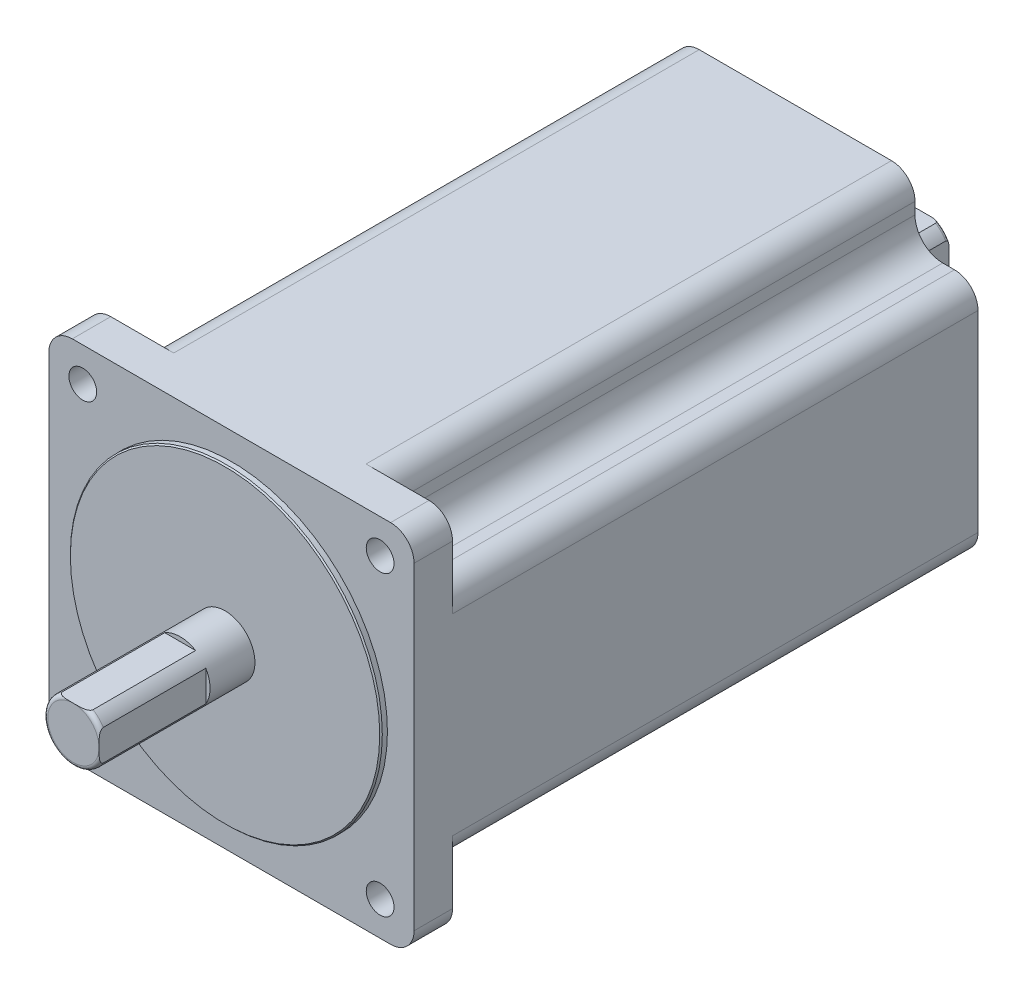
ISO-10303-21;
HEADER;
FILE_DESCRIPTION(('STEP AP214'),'2;1');
FILE_NAME('part.step','',(''),(''),'','','');
FILE_SCHEMA(('AUTOMOTIVE_DESIGN { 1 0 10303 214 1 1 1 1 }'));
ENDSEC;
DATA;
#1=APPLICATION_CONTEXT('core data for automotive mechanical design processes');
#2=APPLICATION_PROTOCOL_DEFINITION('international standard','automotive_design',2000,#1);
#3=PRODUCT_CONTEXT('',#1,'mechanical');
#4=PRODUCT('Part','Part','',(#3));
#5=PRODUCT_RELATED_PRODUCT_CATEGORY('part','',(#4));
#6=PRODUCT_DEFINITION_FORMATION('','',#4);
#7=PRODUCT_DEFINITION_CONTEXT('part definition',#1,'design');
#8=PRODUCT_DEFINITION('design','',#6,#7);
#9=PRODUCT_DEFINITION_SHAPE('','',#8);
#10=(LENGTH_UNIT() NAMED_UNIT(*) SI_UNIT(.MILLI.,.METRE.));
#11=(NAMED_UNIT(*) PLANE_ANGLE_UNIT() SI_UNIT($,.RADIAN.));
#12=(NAMED_UNIT(*) SI_UNIT($,.STERADIAN.) SOLID_ANGLE_UNIT());
#13=UNCERTAINTY_MEASURE_WITH_UNIT(LENGTH_MEASURE(1.E-05),#10,'distance_accuracy_value','');
#14=(GEOMETRIC_REPRESENTATION_CONTEXT(3) GLOBAL_UNCERTAINTY_ASSIGNED_CONTEXT((#13)) GLOBAL_UNIT_ASSIGNED_CONTEXT((#10,
#11,#12)) REPRESENTATION_CONTEXT('',''));
#15=CARTESIAN_POINT('',(0.,0.,0.));
#16=DIRECTION('',(0.,0.,1.));
#17=DIRECTION('',(1.,0.,0.));
#18=AXIS2_PLACEMENT_3D('',#15,#16,#17);
#19=CARTESIAN_POINT('',(0.,0.,-163.5));
#20=DIRECTION('',(0.,0.,1.));
#21=DIRECTION('',(1.,0.,0.));
#22=AXIS2_PLACEMENT_3D('',#19,#20,#21);
#23=CYLINDRICAL_SURFACE('',#22,7.);
#24=CARTESIAN_POINT('',(0.,0.,-162.7));
#25=DIRECTION('',(0.,0.,-1.));
#26=DIRECTION('',(-1.,0.,0.));
#27=AXIS2_PLACEMENT_3D('',#24,#25,#26);
#28=CIRCLE('',#27,7.);
#29=CARTESIAN_POINT('',(6.,3.60555127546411,-162.7));
#30=VERTEX_POINT('',#29);
#31=CARTESIAN_POINT('',(3.60555127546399,6.,-162.7));
#32=VERTEX_POINT('',#31);
#33=EDGE_CURVE('E486',#30,#32,#28,.F.);
#34=ORIENTED_EDGE('',*,*,#33,.T.);
#35=DIRECTION('',(0.,0.,1.));
#36=VECTOR('',#35,1.);
#37=CARTESIAN_POINT('',(3.60555127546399,6.,-163.5));
#38=LINE('',#37,#36);
#39=CARTESIAN_POINT('',(3.60555127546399,6.,-138.5));
#40=VERTEX_POINT('',#39);
#41=EDGE_CURVE('E162',#32,#40,#38,.T.);
#42=ORIENTED_EDGE('',*,*,#41,.T.);
#43=CARTESIAN_POINT('',(0.,0.,-138.5));
#44=DIRECTION('',(0.,0.,-1.));
#45=DIRECTION('',(-1.,0.,0.));
#46=AXIS2_PLACEMENT_3D('',#43,#44,#45);
#47=CIRCLE('',#46,7.);
#48=CARTESIAN_POINT('',(-3.60555127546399,6.,-138.5));
#49=VERTEX_POINT('',#48);
#50=EDGE_CURVE('E12',#49,#40,#47,.T.);
#51=ORIENTED_EDGE('',*,*,#50,.F.);
#52=DIRECTION('',(0.,0.,1.));
#53=VECTOR('',#52,1.);
#54=CARTESIAN_POINT('',(-3.60555127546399,6.,-163.5));
#55=LINE('',#54,#53);
#56=CARTESIAN_POINT('',(-3.60555127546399,6.,-162.7));
#57=VERTEX_POINT('',#56);
#58=EDGE_CURVE('E1475',#49,#57,#55,.F.);
#59=ORIENTED_EDGE('',*,*,#58,.T.);
#60=CARTESIAN_POINT('',(6.,-3.60555127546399,-162.7));
#61=VERTEX_POINT('',#60);
#62=EDGE_CURVE('E480',#57,#61,#28,.F.);
#63=ORIENTED_EDGE('',*,*,#62,.T.);
#64=DIRECTION('',(0.,0.,1.));
#65=VECTOR('',#64,1.);
#66=CARTESIAN_POINT('',(6.,-3.60555127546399,-163.5));
#67=LINE('',#66,#65);
#68=CARTESIAN_POINT('',(6.,-3.60555127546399,-138.5));
#69=VERTEX_POINT('',#68);
#70=EDGE_CURVE('E458',#69,#61,#67,.F.);
#71=ORIENTED_EDGE('',*,*,#70,.F.);
#72=CARTESIAN_POINT('',(6.,3.60555127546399,-138.5));
#73=VERTEX_POINT('',#72);
#74=EDGE_CURVE('E143',#73,#69,#47,.T.);
#75=ORIENTED_EDGE('',*,*,#74,.F.);
#76=DIRECTION('',(0.,0.,1.));
#77=VECTOR('',#76,1.);
#78=CARTESIAN_POINT('',(6.,3.60555127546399,-163.5));
#79=LINE('',#78,#77);
#80=EDGE_CURVE('E1477',#30,#73,#79,.T.);
#81=ORIENTED_EDGE('',*,*,#80,.F.);
#82=EDGE_LOOP('',(#34,#42,#51,#59,#63,#71,#75,#81));
#83=FACE_BOUND('',#82,.T.);
#84=CARTESIAN_POINT('',(0.,0.,-133.5));
#85=DIRECTION('',(0.,0.,-1.));
#86=DIRECTION('',(-1.,0.,0.));
#87=AXIS2_PLACEMENT_3D('',#84,#85,#86);
#88=CIRCLE('',#87,7.);
#89=CARTESIAN_POINT('',(-7.,0.,-133.5));
#90=VERTEX_POINT('',#89);
#91=EDGE_CURVE('E582',#90,#90,#88,.T.);
#92=ORIENTED_EDGE('',*,*,#91,.T.);
#93=EDGE_LOOP('',(#92));
#94=FACE_BOUND('',#93,.T.);
#95=ADVANCED_FACE('F138',(#83,#94),#23,.T.);
#96=CARTESIAN_POINT('',(0.,0.,-163.5));
#97=DIRECTION('',(0.,0.,-1.));
#98=DIRECTION('',(-1.,0.,0.));
#99=AXIS2_PLACEMENT_3D('',#96,#97,#98);
#100=PLANE('',#99);
#101=DIRECTION('',(-1.,0.,0.));
#102=VECTOR('',#101,1.);
#103=CARTESIAN_POINT('',(0.,6.,-163.5));
#104=LINE('',#103,#102);
#105=CARTESIAN_POINT('',(1.56204993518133,6.,-163.5));
#106=VERTEX_POINT('',#105);
#107=CARTESIAN_POINT('',(-1.56204993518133,6.,-163.5));
#108=VERTEX_POINT('',#107);
#109=EDGE_CURVE('E1478',#106,#108,#104,.T.);
#110=ORIENTED_EDGE('',*,*,#109,.F.);
#111=CARTESIAN_POINT('',(0.,0.,-163.5));
#112=DIRECTION('',(0.,0.,-1.));
#113=DIRECTION('',(-1.,0.,0.));
#114=AXIS2_PLACEMENT_3D('',#111,#112,#113);
#115=CIRCLE('',#114,6.2);
#116=CARTESIAN_POINT('',(6.,1.56204993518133,-163.5));
#117=VERTEX_POINT('',#116);
#118=EDGE_CURVE('E473',#106,#117,#115,.T.);
#119=ORIENTED_EDGE('',*,*,#118,.T.);
#120=DIRECTION('',(0.,-1.,0.));
#121=VECTOR('',#120,1.);
#122=CARTESIAN_POINT('',(6.,0.,-163.5));
#123=LINE('',#122,#121);
#124=CARTESIAN_POINT('',(6.,-1.56204993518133,-163.5));
#125=VERTEX_POINT('',#124);
#126=EDGE_CURVE('E154',#117,#125,#123,.T.);
#127=ORIENTED_EDGE('',*,*,#126,.T.);
#128=EDGE_CURVE('E471',#125,#108,#115,.T.);
#129=ORIENTED_EDGE('',*,*,#128,.T.);
#130=EDGE_LOOP('',(#110,#119,#127,#129));
#131=FACE_BOUND('',#130,.T.);
#132=ADVANCED_FACE('F470',(#131),#100,.T.);
#133=CARTESIAN_POINT('',(0.,0.,-162.7));
#134=DIRECTION('',(0.,0.,-1.));
#135=DIRECTION('',(-1.,0.,0.));
#136=AXIS2_PLACEMENT_3D('',#133,#134,#135);
#137=TOROIDAL_SURFACE('',#136,6.2,0.8);
#138=CARTESIAN_POINT('',(-0.485270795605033,6.,-163.479392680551));
#139=CARTESIAN_POINT('',(-0.618493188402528,6.,-163.481882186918));
#140=CARTESIAN_POINT('',(-0.75169852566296,6.,-163.485182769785));
#141=CARTESIAN_POINT('',(-1.01814605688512,6.,-163.4918393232));
#142=CARTESIAN_POINT('',(-1.15138825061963,6.,-163.495195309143));
#143=CARTESIAN_POINT('',(-1.41817812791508,6.,-163.499678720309));
#144=CARTESIAN_POINT('',(-1.5517259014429,6.,-163.500801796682));
#145=CARTESIAN_POINT('',(-1.81875254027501,6.,-163.497903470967));
#146=CARTESIAN_POINT('',(-1.95223140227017,6.,-163.493884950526));
#147=CARTESIAN_POINT('',(-2.1525496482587,6.,-163.481139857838));
#148=CARTESIAN_POINT('',(-2.21959289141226,6.,-163.475738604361));
#149=CARTESIAN_POINT('',(-2.35337842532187,6.,-163.462053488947));
#150=CARTESIAN_POINT('',(-2.42012078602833,6.,-163.45377033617));
#151=CARTESIAN_POINT('',(-2.55284272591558,6.,-163.433624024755));
#152=CARTESIAN_POINT('',(-2.61882413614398,6.,-163.421773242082));
#153=CARTESIAN_POINT('',(-2.74980040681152,6.,-163.39357506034));
#154=CARTESIAN_POINT('',(-2.81479595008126,6.,-163.377230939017));
#155=CARTESIAN_POINT('',(-2.93441731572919,6.,-163.341453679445));
#156=CARTESIAN_POINT('',(-2.9892545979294,6.,-163.322739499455));
#157=CARTESIAN_POINT('',(-3.09704641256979,6.,-163.279966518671));
#158=CARTESIAN_POINT('',(-3.14999509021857,6.,-163.25589253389));
#159=CARTESIAN_POINT('',(-3.25315536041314,6.,-163.200724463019));
#160=CARTESIAN_POINT('',(-3.30331698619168,6.,-163.169534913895));
#161=CARTESIAN_POINT('',(-3.39719193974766,6.,-163.098643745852));
#162=CARTESIAN_POINT('',(-3.44094249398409,6.,-163.058994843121));
#163=CARTESIAN_POINT('',(-3.4969863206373,6.,-162.993208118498));
#164=CARTESIAN_POINT('',(-3.5137456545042,6.,-162.970886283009));
#165=CARTESIAN_POINT('',(-3.54382531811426,6.,-162.924000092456));
#166=CARTESIAN_POINT('',(-3.55714676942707,6.,-162.899436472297));
#167=CARTESIAN_POINT('',(-3.57951911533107,6.,-162.848076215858));
#168=CARTESIAN_POINT('',(-3.58852199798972,6.,-162.821258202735));
#169=CARTESIAN_POINT('',(-3.60112191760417,6.,-162.766381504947));
#170=CARTESIAN_POINT('',(-3.60472621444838,6.,-162.738324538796));
#171=CARTESIAN_POINT('',(-3.60603762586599,6.,-162.685545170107));
#172=CARTESIAN_POINT('',(-3.60441630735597,6.,-162.6608376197));
#173=CARTESIAN_POINT('',(-3.5968692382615,6.,-162.612090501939));
#174=CARTESIAN_POINT('',(-3.59094198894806,6.,-162.58805117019));
#175=CARTESIAN_POINT('',(-3.57556208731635,6.,-162.542101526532));
#176=CARTESIAN_POINT('',(-3.56624193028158,6.,-162.520145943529));
#177=CARTESIAN_POINT('',(-3.54465453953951,6.,-162.477757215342));
#178=CARTESIAN_POINT('',(-3.53238674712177,6.,-162.457324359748));
#179=CARTESIAN_POINT('',(-3.49673875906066,6.,-162.405357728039));
#180=CARTESIAN_POINT('',(-3.47131413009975,6.,-162.375226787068));
#181=CARTESIAN_POINT('',(-3.4160876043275,6.,-162.31925352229));
#182=CARTESIAN_POINT('',(-3.38627063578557,6.,-162.293426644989));
#183=CARTESIAN_POINT('',(-3.30186141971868,6.,-162.228882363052));
#184=CARTESIAN_POINT('',(-3.24452658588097,6.,-162.19378275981));
#185=CARTESIAN_POINT('',(-3.12560762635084,6.,-162.132218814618));
#186=CARTESIAN_POINT('',(-3.06402084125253,6.,-162.105759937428));
#187=CARTESIAN_POINT('',(-2.92063417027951,6.,-162.052897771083));
#188=CARTESIAN_POINT('',(-2.83805677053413,6.,-162.028639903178));
#189=CARTESIAN_POINT('',(-2.67091767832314,6.,-161.988106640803));
#190=CARTESIAN_POINT('',(-2.58635250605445,6.,-161.97184653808));
#191=CARTESIAN_POINT('',(-2.41550414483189,6.,-161.945202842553));
#192=CARTESIAN_POINT('',(-2.32921225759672,6.,-161.934877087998));
#193=CARTESIAN_POINT('',(-2.15632310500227,6.,-161.918793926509));
#194=CARTESIAN_POINT('',(-2.06972625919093,6.,-161.913031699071));
#195=CARTESIAN_POINT('',(-1.88956616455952,6.,-161.904511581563));
#196=CARTESIAN_POINT('',(-1.79599109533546,6.,-161.902025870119));
#197=CARTESIAN_POINT('',(-1.60880320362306,6.,-161.899671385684));
#198=CARTESIAN_POINT('',(-1.51519037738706,6.,-161.899803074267));
#199=CARTESIAN_POINT('',(-1.32791166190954,6.,-161.901633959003));
#200=CARTESIAN_POINT('',(-1.23424578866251,6.,-161.903334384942));
#201=CARTESIAN_POINT('',(-1.04692816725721,6.,-161.907408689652));
#202=CARTESIAN_POINT('',(-0.953276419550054,6.,-161.909782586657));
#203=CARTESIAN_POINT('',(-0.765693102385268,6.,-161.914466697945));
#204=CARTESIAN_POINT('',(-0.671761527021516,6.,-161.916776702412));
#205=CARTESIAN_POINT('',(-0.483883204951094,6.,-161.920747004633));
#206=CARTESIAN_POINT('',(-0.389936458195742,6.,-161.922407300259));
#207=CARTESIAN_POINT('',(-0.202106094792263,6.,-161.924703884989));
#208=CARTESIAN_POINT('',(-0.108222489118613,6.,-161.925341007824));
#209=CARTESIAN_POINT('',(0.07954474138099,6.,-161.925456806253));
#210=CARTESIAN_POINT('',(0.173428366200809,6.,-161.924935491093));
#211=CARTESIAN_POINT('',(0.360161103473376,6.,-161.922857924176));
#212=CARTESIAN_POINT('',(0.453010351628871,6.,-161.921313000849));
#213=CARTESIAN_POINT('',(0.638696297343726,6.,-161.917536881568));
#214=CARTESIAN_POINT('',(0.731532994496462,6.,-161.915305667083));
#215=CARTESIAN_POINT('',(0.917332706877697,6.,-161.9106903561));
#216=CARTESIAN_POINT('',(1.01029571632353,6.,-161.908306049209));
#217=CARTESIAN_POINT('',(1.19624163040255,6.,-161.904094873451));
#218=CARTESIAN_POINT('',(1.28922453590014,6.,-161.902268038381));
#219=CARTESIAN_POINT('',(1.47469216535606,6.,-161.900034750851));
#220=CARTESIAN_POINT('',(1.56717677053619,6.,-161.899620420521));
#221=CARTESIAN_POINT('',(1.75212153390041,6.,-161.901180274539));
#222=CARTESIAN_POINT('',(1.84458169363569,6.,-161.903154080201));
#223=CARTESIAN_POINT('',(2.02917883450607,6.,-161.91065514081));
#224=CARTESIAN_POINT('',(2.12131608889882,6.,-161.916175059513));
#225=CARTESIAN_POINT('',(2.30514593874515,6.,-161.932177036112));
#226=CARTESIAN_POINT('',(2.39683877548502,6.,-161.942656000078));
#227=CARTESIAN_POINT('',(2.52748287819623,6.,-161.962544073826));
#228=CARTESIAN_POINT('',(2.56685652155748,6.,-161.969190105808));
#229=CARTESIAN_POINT('',(2.64535310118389,6.,-161.983953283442));
#230=CARTESIAN_POINT('',(2.68447587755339,6.,-161.992071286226));
#231=CARTESIAN_POINT('',(2.76244729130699,6.,-162.010013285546));
#232=CARTESIAN_POINT('',(2.80129491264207,6.,-162.019841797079));
#233=CARTESIAN_POINT('',(2.87842421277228,6.,-162.041442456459));
#234=CARTESIAN_POINT('',(2.91670600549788,6.,-162.053214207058));
#235=CARTESIAN_POINT('',(3.03157772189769,6.,-162.092267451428));
#236=CARTESIAN_POINT('',(3.10709746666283,6.,-162.1230537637));
#237=CARTESIAN_POINT('',(3.21541606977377,6.,-162.178528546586));
#238=CARTESIAN_POINT('',(3.25062687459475,6.,-162.198517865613));
#239=CARTESIAN_POINT('',(3.31868978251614,6.,-162.242141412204));
#240=CARTESIAN_POINT('',(3.35154584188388,6.,-162.265769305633));
#241=CARTESIAN_POINT('',(3.40647692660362,6.,-162.311198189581));
#242=CARTESIAN_POINT('',(3.42927092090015,6.,-162.332123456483));
#243=CARTESIAN_POINT('',(3.47209230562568,6.,-162.376693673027));
#244=CARTESIAN_POINT('',(3.49211879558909,6.,-162.400339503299));
#245=CARTESIAN_POINT('',(3.52858598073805,6.,-162.450727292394));
#246=CARTESIAN_POINT('',(3.54498203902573,6.,-162.477502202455));
#247=CARTESIAN_POINT('',(3.57253222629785,6.,-162.53363076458));
#248=CARTESIAN_POINT('',(3.58369824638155,6.,-162.562978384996));
#249=CARTESIAN_POINT('',(3.59760273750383,6.,-162.615964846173));
#250=CARTESIAN_POINT('',(3.60173644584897,6.,-162.639238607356));
#251=CARTESIAN_POINT('',(3.60598619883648,6.,-162.686149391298));
#252=CARTESIAN_POINT('',(3.60610436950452,6.,-162.709786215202));
#253=CARTESIAN_POINT('',(3.60231413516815,6.,-162.756707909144));
#254=CARTESIAN_POINT('',(3.59840914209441,6.,-162.779993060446));
#255=CARTESIAN_POINT('',(3.58690158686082,6.,-162.825626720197));
#256=CARTESIAN_POINT('',(3.57929649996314,6.,-162.847974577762));
#257=CARTESIAN_POINT('',(3.55800797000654,6.,-162.898138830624));
#258=CARTESIAN_POINT('',(3.54316456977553,6.,-162.925461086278));
#259=CARTESIAN_POINT('',(3.50927363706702,6.,-162.977352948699));
#260=CARTESIAN_POINT('',(3.49021755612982,6.,-163.001916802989));
#261=CARTESIAN_POINT('',(3.43830757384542,6.,-163.06034900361));
#262=CARTESIAN_POINT('',(3.40343347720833,6.,-163.092408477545));
#263=CARTESIAN_POINT('',(3.32929807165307,6.,-163.150908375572));
#264=CARTESIAN_POINT('',(3.29002730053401,6.,-163.177336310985));
#265=CARTESIAN_POINT('',(3.21215770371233,6.,-163.223435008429));
#266=CARTESIAN_POINT('',(3.1737803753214,6.,-163.243487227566));
#267=CARTESIAN_POINT('',(3.09543949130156,6.,-163.280255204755));
#268=CARTESIAN_POINT('',(3.05547451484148,6.,-163.296967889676));
#269=CARTESIAN_POINT('',(2.97441243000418,6.,-163.327577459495));
#270=CARTESIAN_POINT('',(2.9333134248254,6.,-163.341469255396));
#271=CARTESIAN_POINT('',(2.85040651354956,6.,-163.366810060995));
#272=CARTESIAN_POINT('',(2.80859904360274,6.,-163.378260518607));
#273=CARTESIAN_POINT('',(2.68190249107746,6.,-163.409628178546));
#274=CARTESIAN_POINT('',(2.59623113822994,6.,-163.426387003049));
#275=CARTESIAN_POINT('',(2.4238808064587,6.,-163.453694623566));
#276=CARTESIAN_POINT('',(2.33720083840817,6.,-163.464236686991));
#277=CARTESIAN_POINT('',(2.16312068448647,6.,-163.48070518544));
#278=CARTESIAN_POINT('',(2.07571904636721,6.,-163.48661560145));
#279=CARTESIAN_POINT('',(1.90074424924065,6.,-163.49502506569));
#280=CARTESIAN_POINT('',(1.81317104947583,6.,-163.497523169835));
#281=CARTESIAN_POINT('',(1.63734126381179,6.,-163.500151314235));
#282=CARTESIAN_POINT('',(1.54908447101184,6.,-163.500263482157));
#283=CARTESIAN_POINT('',(1.37258075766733,6.,-163.49897223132));
#284=CARTESIAN_POINT('',(1.28433383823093,6.,-163.49756870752));
#285=CARTESIAN_POINT('',(1.10802656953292,6.,-163.494019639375));
#286=CARTESIAN_POINT('',(1.0199661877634,6.,-163.491875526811));
#287=CARTESIAN_POINT('',(0.843851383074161,6.,-163.487492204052));
#288=CARTESIAN_POINT('',(0.755796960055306,6.,-163.485252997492));
#289=CARTESIAN_POINT('',(0.571520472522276,6.,-163.48101343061));
#290=CARTESIAN_POINT('',(0.475297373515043,6.,-163.479054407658));
#291=CARTESIAN_POINT('',(0.282799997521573,6.,-163.476119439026));
#292=CARTESIAN_POINT('',(0.186525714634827,6.,-163.475143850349));
#293=CARTESIAN_POINT('',(-0.00568268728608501,6.,-163.474400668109));
#294=CARTESIAN_POINT('',(-0.101616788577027,6.,-163.474628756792));
#295=CARTESIAN_POINT('',(-0.293460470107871,6.,-163.476228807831));
#296=CARTESIAN_POINT('',(-0.389370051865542,6.,-163.477600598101));
#297=CARTESIAN_POINT('',(-0.485270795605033,6.,-163.479392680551));
#298=B_SPLINE_CURVE_WITH_KNOTS('',3,(#138,#139,#140,#141,#142,#143,#144,#145,#146,#147,#148,
#149,#150,#151,#152,#153,#154,#155,#156,#157,#158,#159,#160,#161,#162,#163,#164,#165,#166,#167,
#168,#169,#170,#171,#172,#173,#174,#175,#176,#177,#178,#179,#180,#181,#182,#183,#184,#185,#186,
#187,#188,#189,#190,#191,#192,#193,#194,#195,#196,#197,#198,#199,#200,#201,#202,#203,#204,#205,
#206,#207,#208,#209,#210,#211,#212,#213,#214,#215,#216,#217,#218,#219,#220,#221,#222,#223,#224,
#225,#226,#227,#228,#229,#230,#231,#232,#233,#234,#235,#236,#237,#238,#239,#240,#241,#242,#243,
#244,#245,#246,#247,#248,#249,#250,#251,#252,#253,#254,#255,#256,#257,#258,#259,#260,#261,#262,
#263,#264,#265,#266,#267,#268,#269,#270,#271,#272,#273,#274,#275,#276,#277,#278,#279,#280,#281,
#282,#283,#284,#285,#286,#287,#288,#289,#290,#291,#292,#293,#294,#295,#296,#297),.UNSPECIFIED.,
.T.,.F.,(4,2,2,2,2,2,2,2,2,2,2,2,2,2,2,2,2,2,2,2,2,2,2,2,2,2,2,2,2,2,2,2,2,2,2,2,2,2,2,2,2,2,2,
2,2,2,2,2,2,2,2,2,2,2,2,2,2,2,2,2,2,2,2,2,2,2,2,2,2,2,2,2,2,2,2,2,2,2,2,4),(0.,0.3997366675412,
0.799586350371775,1.2002140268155,1.60061726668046,1.80235120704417,2.00403554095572,
2.20502814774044,2.40587452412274,2.5794978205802,2.75361938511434,2.93023084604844,
3.10577228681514,3.18927272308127,3.27274588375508,3.35712670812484,3.44139395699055,
3.51528383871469,3.58919945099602,3.66049342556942,3.73180092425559,3.84939158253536,
3.96739556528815,4.1679312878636,4.36859359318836,4.62618499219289,4.88426701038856,
5.14482349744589,5.40510438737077,5.68587256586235,5.96669025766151,6.24772827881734,
6.52877390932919,6.81065330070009,7.09253361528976,7.37418412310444,7.65583238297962,
7.9344145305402,8.21300420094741,8.49198528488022,8.77098327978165,9.04842266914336,
9.32581807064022,9.60264143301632,9.87929231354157,9.99906133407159,10.1189003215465,
10.2390605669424,10.359196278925,10.6028176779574,10.7241215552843,10.8452166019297,
10.9378517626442,11.0305169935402,11.1242650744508,11.2177989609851,11.2883939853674,
11.3589516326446,11.429449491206,11.4999955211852,11.5927575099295,11.6857094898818,
11.8270259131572,11.9686525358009,12.0983623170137,12.2281909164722,12.3582516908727,
12.4882351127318,12.7497600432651,13.0115676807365,13.2742768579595,13.5370587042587,
13.8018082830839,14.0665762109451,14.3308351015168,14.5950839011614,14.8838100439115,
15.172640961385,15.4604365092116,15.748188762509),.UNSPECIFIED.);
#299=EDGE_CURVE('E477',#108,#57,#298,.T.);
#300=ORIENTED_EDGE('',*,*,#299,.F.);
#301=ORIENTED_EDGE('',*,*,#128,.F.);
#302=CARTESIAN_POINT('',(6.,-0.485270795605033,-163.479392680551));
#303=CARTESIAN_POINT('',(6.,-0.618493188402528,-163.481882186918));
#304=CARTESIAN_POINT('',(6.,-0.75169852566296,-163.485182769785));
#305=CARTESIAN_POINT('',(6.,-1.01814605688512,-163.4918393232));
#306=CARTESIAN_POINT('',(6.,-1.15138825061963,-163.495195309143));
#307=CARTESIAN_POINT('',(6.,-1.41817812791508,-163.499678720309));
#308=CARTESIAN_POINT('',(6.,-1.5517259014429,-163.500801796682));
#309=CARTESIAN_POINT('',(6.,-1.818752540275,-163.497903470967));
#310=CARTESIAN_POINT('',(6.,-1.95223140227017,-163.493884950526));
#311=CARTESIAN_POINT('',(6.,-2.1525496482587,-163.481139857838));
#312=CARTESIAN_POINT('',(6.,-2.21959289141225,-163.475738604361));
#313=CARTESIAN_POINT('',(6.,-2.35337842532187,-163.462053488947));
#314=CARTESIAN_POINT('',(6.,-2.42012078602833,-163.45377033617));
#315=CARTESIAN_POINT('',(6.,-2.55284272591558,-163.433624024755));
#316=CARTESIAN_POINT('',(6.,-2.61882413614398,-163.421773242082));
#317=CARTESIAN_POINT('',(6.,-2.74980040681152,-163.39357506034));
#318=CARTESIAN_POINT('',(6.,-2.81479595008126,-163.377230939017));
#319=CARTESIAN_POINT('',(6.,-2.93441731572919,-163.341453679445));
#320=CARTESIAN_POINT('',(6.,-2.98925459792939,-163.322739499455));
#321=CARTESIAN_POINT('',(6.,-3.09704641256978,-163.279966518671));
#322=CARTESIAN_POINT('',(6.,-3.14999509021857,-163.25589253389));
#323=CARTESIAN_POINT('',(6.,-3.25315536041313,-163.200724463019));
#324=CARTESIAN_POINT('',(6.,-3.30331698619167,-163.169534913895));
#325=CARTESIAN_POINT('',(6.,-3.39719193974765,-163.098643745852));
#326=CARTESIAN_POINT('',(6.,-3.44094249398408,-163.058994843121));
#327=CARTESIAN_POINT('',(6.,-3.49698632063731,-162.993208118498));
#328=CARTESIAN_POINT('',(6.,-3.51374565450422,-162.970886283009));
#329=CARTESIAN_POINT('',(6.,-3.54382531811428,-162.924000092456));
#330=CARTESIAN_POINT('',(6.,-3.55714676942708,-162.899436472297));
#331=CARTESIAN_POINT('',(6.,-3.57951911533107,-162.848076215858));
#332=CARTESIAN_POINT('',(6.,-3.58852199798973,-162.821258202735));
#333=CARTESIAN_POINT('',(6.,-3.60112191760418,-162.766381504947));
#334=CARTESIAN_POINT('',(6.,-3.60472621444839,-162.738324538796));
#335=CARTESIAN_POINT('',(6.,-3.60603762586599,-162.685545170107));
#336=CARTESIAN_POINT('',(6.,-3.60441630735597,-162.6608376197));
#337=CARTESIAN_POINT('',(6.,-3.5968692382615,-162.612090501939));
#338=CARTESIAN_POINT('',(6.,-3.59094198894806,-162.58805117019));
#339=CARTESIAN_POINT('',(6.,-3.57556208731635,-162.542101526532));
#340=CARTESIAN_POINT('',(6.,-3.56624193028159,-162.520145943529));
#341=CARTESIAN_POINT('',(6.,-3.54465453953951,-162.477757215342));
#342=CARTESIAN_POINT('',(6.,-3.53238674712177,-162.457324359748));
#343=CARTESIAN_POINT('',(6.,-3.49673875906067,-162.405357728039));
#344=CARTESIAN_POINT('',(6.,-3.47131413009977,-162.375226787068));
#345=CARTESIAN_POINT('',(6.,-3.41608760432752,-162.31925352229));
#346=CARTESIAN_POINT('',(6.,-3.38627063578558,-162.293426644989));
#347=CARTESIAN_POINT('',(6.,-3.30186141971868,-162.228882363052));
#348=CARTESIAN_POINT('',(6.,-3.24452658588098,-162.19378275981));
#349=CARTESIAN_POINT('',(6.,-3.12560762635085,-162.132218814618));
#350=CARTESIAN_POINT('',(6.,-3.06402084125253,-162.105759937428));
#351=CARTESIAN_POINT('',(6.,-2.92063417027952,-162.052897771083));
#352=CARTESIAN_POINT('',(6.,-2.83805677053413,-162.028639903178));
#353=CARTESIAN_POINT('',(6.,-2.67091767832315,-161.988106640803));
#354=CARTESIAN_POINT('',(6.,-2.58635250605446,-161.97184653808));
#355=CARTESIAN_POINT('',(6.,-2.4155041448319,-161.945202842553));
#356=CARTESIAN_POINT('',(6.,-2.32921225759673,-161.934877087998));
#357=CARTESIAN_POINT('',(6.,-2.15632310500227,-161.918793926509));
#358=CARTESIAN_POINT('',(6.,-2.06972625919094,-161.913031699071));
#359=CARTESIAN_POINT('',(6.,-1.88956616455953,-161.904511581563));
#360=CARTESIAN_POINT('',(6.,-1.79599109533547,-161.902025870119));
#361=CARTESIAN_POINT('',(6.,-1.60880320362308,-161.899671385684));
#362=CARTESIAN_POINT('',(6.,-1.51519037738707,-161.899803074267));
#363=CARTESIAN_POINT('',(6.,-1.32791166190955,-161.901633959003));
#364=CARTESIAN_POINT('',(6.,-1.23424578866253,-161.903334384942));
#365=CARTESIAN_POINT('',(6.,-1.04692816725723,-161.907408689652));
#366=CARTESIAN_POINT('',(6.,-0.953276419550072,-161.909782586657));
#367=CARTESIAN_POINT('',(6.,-0.765693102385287,-161.914466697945));
#368=CARTESIAN_POINT('',(6.,-0.671761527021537,-161.916776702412));
#369=CARTESIAN_POINT('',(6.,-0.483883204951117,-161.920747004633));
#370=CARTESIAN_POINT('',(6.,-0.389936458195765,-161.922407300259));
#371=CARTESIAN_POINT('',(6.,-0.202106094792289,-161.924703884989));
#372=CARTESIAN_POINT('',(6.,-0.10822248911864,-161.925341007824));
#373=CARTESIAN_POINT('',(6.,0.0795447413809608,-161.925456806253));
#374=CARTESIAN_POINT('',(6.,0.173428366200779,-161.924935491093));
#375=CARTESIAN_POINT('',(6.,0.360161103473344,-161.922857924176));
#376=CARTESIAN_POINT('',(6.,0.453010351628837,-161.921313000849));
#377=CARTESIAN_POINT('',(6.,0.638696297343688,-161.917536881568));
#378=CARTESIAN_POINT('',(6.,0.731532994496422,-161.915305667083));
#379=CARTESIAN_POINT('',(6.,0.917332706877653,-161.9106903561));
#380=CARTESIAN_POINT('',(6.,1.01029571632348,-161.908306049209));
#381=CARTESIAN_POINT('',(6.,1.1962416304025,-161.904094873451));
#382=CARTESIAN_POINT('',(6.,1.28922453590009,-161.902268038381));
#383=CARTESIAN_POINT('',(6.,1.47469216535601,-161.900034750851));
#384=CARTESIAN_POINT('',(6.,1.56717677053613,-161.899620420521));
#385=CARTESIAN_POINT('',(6.,1.75212153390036,-161.901180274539));
#386=CARTESIAN_POINT('',(6.,1.84458169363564,-161.903154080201));
#387=CARTESIAN_POINT('',(6.,2.02917883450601,-161.91065514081));
#388=CARTESIAN_POINT('',(6.,2.12131608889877,-161.916175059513));
#389=CARTESIAN_POINT('',(6.,2.3051459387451,-161.932177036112));
#390=CARTESIAN_POINT('',(6.,2.39683877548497,-161.942656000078));
#391=CARTESIAN_POINT('',(6.,2.52748287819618,-161.962544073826));
#392=CARTESIAN_POINT('',(6.,2.56685652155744,-161.969190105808));
#393=CARTESIAN_POINT('',(6.,2.64535310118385,-161.983953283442));
#394=CARTESIAN_POINT('',(6.,2.68447587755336,-161.992071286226));
#395=CARTESIAN_POINT('',(6.,2.76244729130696,-162.010013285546));
#396=CARTESIAN_POINT('',(6.,2.80129491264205,-162.019841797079));
#397=CARTESIAN_POINT('',(6.,2.87842421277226,-162.041442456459));
#398=CARTESIAN_POINT('',(6.,2.91670600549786,-162.053214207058));
#399=CARTESIAN_POINT('',(6.,3.03157772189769,-162.092267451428));
#400=CARTESIAN_POINT('',(6.,3.10709746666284,-162.1230537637));
#401=CARTESIAN_POINT('',(6.,3.21541606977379,-162.178528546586));
#402=CARTESIAN_POINT('',(6.,3.25062687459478,-162.198517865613));
#403=CARTESIAN_POINT('',(6.,3.31868978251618,-162.242141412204));
#404=CARTESIAN_POINT('',(6.,3.35154584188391,-162.265769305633));
#405=CARTESIAN_POINT('',(6.,3.40647692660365,-162.311198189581));
#406=CARTESIAN_POINT('',(6.,3.42927092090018,-162.332123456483));
#407=CARTESIAN_POINT('',(6.,3.4720923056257,-162.376693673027));
#408=CARTESIAN_POINT('',(6.,3.49211879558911,-162.400339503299));
#409=CARTESIAN_POINT('',(6.,3.52858598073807,-162.450727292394));
#410=CARTESIAN_POINT('',(6.,3.54498203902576,-162.477502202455));
#411=CARTESIAN_POINT('',(6.,3.57253222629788,-162.53363076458));
#412=CARTESIAN_POINT('',(6.,3.58369824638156,-162.562978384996));
#413=CARTESIAN_POINT('',(6.,3.59760273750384,-162.615964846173));
#414=CARTESIAN_POINT('',(6.,3.60173644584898,-162.639238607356));
#415=CARTESIAN_POINT('',(6.,3.60598619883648,-162.686149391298));
#416=CARTESIAN_POINT('',(6.,3.60610436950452,-162.709786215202));
#417=CARTESIAN_POINT('',(6.,3.60231413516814,-162.756707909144));
#418=CARTESIAN_POINT('',(6.,3.59840914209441,-162.779993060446));
#419=CARTESIAN_POINT('',(6.,3.58690158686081,-162.825626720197));
#420=CARTESIAN_POINT('',(6.,3.57929649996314,-162.847974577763));
#421=CARTESIAN_POINT('',(6.,3.55800797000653,-162.898138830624));
#422=CARTESIAN_POINT('',(6.,3.54316456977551,-162.925461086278));
#423=CARTESIAN_POINT('',(6.,3.50927363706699,-162.977352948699));
#424=CARTESIAN_POINT('',(6.,3.49021755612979,-163.001916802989));
#425=CARTESIAN_POINT('',(6.,3.43830757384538,-163.06034900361));
#426=CARTESIAN_POINT('',(6.,3.40343347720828,-163.092408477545));
#427=CARTESIAN_POINT('',(6.,3.329298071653,-163.150908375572));
#428=CARTESIAN_POINT('',(6.,3.29002730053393,-163.177336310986));
#429=CARTESIAN_POINT('',(6.,3.21215770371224,-163.223435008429));
#430=CARTESIAN_POINT('',(6.,3.17378037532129,-163.243487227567));
#431=CARTESIAN_POINT('',(6.,3.09543949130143,-163.280255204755));
#432=CARTESIAN_POINT('',(6.,3.05547451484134,-163.296967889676));
#433=CARTESIAN_POINT('',(6.,2.97441243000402,-163.327577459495));
#434=CARTESIAN_POINT('',(6.,2.93331342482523,-163.341469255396));
#435=CARTESIAN_POINT('',(6.,2.85040651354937,-163.366810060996));
#436=CARTESIAN_POINT('',(6.,2.80859904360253,-163.378260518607));
#437=CARTESIAN_POINT('',(6.,2.6819024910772,-163.409628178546));
#438=CARTESIAN_POINT('',(6.,2.59623113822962,-163.426387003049));
#439=CARTESIAN_POINT('',(6.,2.42388080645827,-163.453694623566));
#440=CARTESIAN_POINT('',(6.,2.33720083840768,-163.464236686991));
#441=CARTESIAN_POINT('',(6.,2.16312068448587,-163.48070518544));
#442=CARTESIAN_POINT('',(6.,2.07571904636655,-163.48661560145));
#443=CARTESIAN_POINT('',(6.,1.90074424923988,-163.49502506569));
#444=CARTESIAN_POINT('',(6.,1.81317104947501,-163.497523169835));
#445=CARTESIAN_POINT('',(6.,1.63734126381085,-163.500151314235));
#446=CARTESIAN_POINT('',(6.,1.54908447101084,-163.500263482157));
#447=CARTESIAN_POINT('',(6.,1.37258075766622,-163.49897223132));
#448=CARTESIAN_POINT('',(6.,1.28433383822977,-163.49756870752));
#449=CARTESIAN_POINT('',(6.,1.10802656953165,-163.494019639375));
#450=CARTESIAN_POINT('',(6.,1.01996618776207,-163.491875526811));
#451=CARTESIAN_POINT('',(6.,0.84385138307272,-163.487492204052));
#452=CARTESIAN_POINT('',(6.,0.755796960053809,-163.485252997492));
#453=CARTESIAN_POINT('',(6.,0.571520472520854,-163.48101343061));
#454=CARTESIAN_POINT('',(6.,0.47529737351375,-163.479054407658));
#455=CARTESIAN_POINT('',(6.,0.282799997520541,-163.476119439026));
#456=CARTESIAN_POINT('',(6.,0.186525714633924,-163.475143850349));
#457=CARTESIAN_POINT('',(6.,-0.00568268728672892,-163.474400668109));
#458=CARTESIAN_POINT('',(6.,-0.101616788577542,-163.474628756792));
#459=CARTESIAN_POINT('',(6.,-0.293460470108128,-163.476228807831));
#460=CARTESIAN_POINT('',(6.,-0.389370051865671,-163.477600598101));
#461=CARTESIAN_POINT('',(6.,-0.485270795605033,-163.479392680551));
#462=B_SPLINE_CURVE_WITH_KNOTS('',3,(#302,#303,#304,#305,#306,#307,#308,#309,#310,#311,#312,
#313,#314,#315,#316,#317,#318,#319,#320,#321,#322,#323,#324,#325,#326,#327,#328,#329,#330,#331,
#332,#333,#334,#335,#336,#337,#338,#339,#340,#341,#342,#343,#344,#345,#346,#347,#348,#349,#350,
#351,#352,#353,#354,#355,#356,#357,#358,#359,#360,#361,#362,#363,#364,#365,#366,#367,#368,#369,
#370,#371,#372,#373,#374,#375,#376,#377,#378,#379,#380,#381,#382,#383,#384,#385,#386,#387,#388,
#389,#390,#391,#392,#393,#394,#395,#396,#397,#398,#399,#400,#401,#402,#403,#404,#405,#406,#407,
#408,#409,#410,#411,#412,#413,#414,#415,#416,#417,#418,#419,#420,#421,#422,#423,#424,#425,#426,
#427,#428,#429,#430,#431,#432,#433,#434,#435,#436,#437,#438,#439,#440,#441,#442,#443,#444,#445,
#446,#447,#448,#449,#450,#451,#452,#453,#454,#455,#456,#457,#458,#459,#460,#461),.UNSPECIFIED.,
.T.,.F.,(4,2,2,2,2,2,2,2,2,2,2,2,2,2,2,2,2,2,2,2,2,2,2,2,2,2,2,2,2,2,2,2,2,2,2,2,2,2,2,2,2,2,2,
2,2,2,2,2,2,2,2,2,2,2,2,2,2,2,2,2,2,2,2,2,2,2,2,2,2,2,2,2,2,2,2,2,2,2,2,4),(0.,
0.399736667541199,0.799586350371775,1.2002140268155,1.60061726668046,1.80235120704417,
2.00403554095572,2.20502814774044,2.40587452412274,2.57949782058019,2.75361938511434,
2.93023084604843,3.10577228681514,3.18927272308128,3.27274588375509,3.35712670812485,
3.44139395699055,3.51528383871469,3.58919945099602,3.66049342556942,3.73180092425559,
3.84939158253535,3.96739556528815,4.1679312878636,4.36859359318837,4.62618499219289,
4.88426701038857,5.14482349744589,5.40510438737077,5.68587256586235,5.9666902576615,
6.24772827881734,6.52877390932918,6.81065330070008,7.09253361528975,7.37418412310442,
7.6558323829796,7.93441453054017,8.21300420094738,8.49198528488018,8.77098327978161,
9.04842266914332,9.32581807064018,9.60264143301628,9.87929231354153,9.99906133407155,
10.1189003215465,10.2390605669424,10.359196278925,10.6028176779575,10.7241215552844,
10.8452166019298,10.9378517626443,11.0305169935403,11.1242650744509,11.2177989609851,
11.2883939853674,11.3589516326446,11.4294494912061,11.4999955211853,11.5927575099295,
11.6857094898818,11.8270259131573,11.968652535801,12.0983623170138,12.2281909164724,
12.3582516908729,12.4882351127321,12.7497600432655,13.0115676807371,13.2742768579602,
13.5370587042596,13.8018082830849,14.0665762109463,14.3308351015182,14.5950839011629,
14.8838100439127,15.1726409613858,15.460436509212,15.748188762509),.UNSPECIFIED.);
#463=EDGE_CURVE('E454',#125,#61,#462,.T.);
#464=ORIENTED_EDGE('',*,*,#463,.T.);
#465=ORIENTED_EDGE('',*,*,#62,.F.);
#466=EDGE_LOOP('',(#300,#301,#464,#465));
#467=FACE_BOUND('',#466,.T.);
#468=ADVANCED_FACE('F140',(#467),#137,.T.);
#469=EDGE_CURVE('E463',#32,#106,#298,.T.);
#470=ORIENTED_EDGE('',*,*,#469,.F.);
#471=ORIENTED_EDGE('',*,*,#33,.F.);
#472=EDGE_CURVE('E464',#30,#117,#462,.T.);
#473=ORIENTED_EDGE('',*,*,#472,.T.);
#474=ORIENTED_EDGE('',*,*,#118,.F.);
#475=EDGE_LOOP('',(#470,#471,#473,#474));
#476=FACE_BOUND('',#475,.T.);
#477=ADVANCED_FACE('F1068',(#476),#137,.T.);
#478=CARTESIAN_POINT('',(0.,0.,-133.5));
#479=DIRECTION('',(0.,0.,-1.));
#480=DIRECTION('',(-1.,0.,0.));
#481=AXIS2_PLACEMENT_3D('',#478,#479,#480);
#482=PLANE('',#481);
#483=DIRECTION('',(1.,0.,0.));
#484=VECTOR('',#483,1.);
#485=CARTESIAN_POINT('',(-42.75,-47.75,-133.5));
#486=LINE('',#485,#484);
#487=CARTESIAN_POINT('',(-13.25,-47.75,-133.5));
#488=VERTEX_POINT('',#487);
#489=CARTESIAN_POINT('',(13.25,-47.75,-133.5));
#490=VERTEX_POINT('',#489);
#491=EDGE_CURVE('E619',#488,#490,#486,.T.);
#492=ORIENTED_EDGE('',*,*,#491,.F.);
#493=DIRECTION('',(0.,1.,0.));
#494=VECTOR('',#493,1.);
#495=CARTESIAN_POINT('',(-13.25,-54.75,-133.5));
#496=LINE('',#495,#494);
#497=CARTESIAN_POINT('',(-13.25,-42.75,-133.5));
#498=VERTEX_POINT('',#497);
#499=EDGE_CURVE('E646',#488,#498,#496,.T.);
#500=ORIENTED_EDGE('',*,*,#499,.T.);
#501=DIRECTION('',(-1.,0.,0.));
#502=VECTOR('',#501,1.);
#503=CARTESIAN_POINT('',(0.,-42.75,-133.5));
#504=LINE('',#503,#502);
#505=CARTESIAN_POINT('',(-22.5,-42.75,-133.5));
#506=VERTEX_POINT('',#505);
#507=EDGE_CURVE('E679',#498,#506,#504,.T.);
#508=ORIENTED_EDGE('',*,*,#507,.T.);
#509=CARTESIAN_POINT('',(-22.5,-37.25,-133.5));
#510=DIRECTION('',(0.,0.,-1.));
#511=DIRECTION('',(-1.,0.,0.));
#512=AXIS2_PLACEMENT_3D('',#509,#510,#511);
#513=CIRCLE('',#512,5.5);
#514=CARTESIAN_POINT('',(-28.,-37.25,-133.5));
#515=VERTEX_POINT('',#514);
#516=EDGE_CURVE('E739',#506,#515,#513,.T.);
#517=ORIENTED_EDGE('',*,*,#516,.T.);
#518=DIRECTION('',(0.,-1.,0.));
#519=VECTOR('',#518,1.);
#520=CARTESIAN_POINT('',(-28.,0.,-133.5));
#521=LINE('',#520,#519);
#522=CARTESIAN_POINT('',(-28.,-34.5,-133.5));
#523=VERTEX_POINT('',#522);
#524=EDGE_CURVE('E649',#523,#515,#521,.T.);
#525=ORIENTED_EDGE('',*,*,#524,.F.);
#526=CARTESIAN_POINT('',(-34.5,-34.5,-133.5));
#527=DIRECTION('',(0.,0.,-1.));
#528=DIRECTION('',(-1.,0.,0.));
#529=AXIS2_PLACEMENT_3D('',#526,#527,#528);
#530=CIRCLE('',#529,6.5);
#531=CARTESIAN_POINT('',(-34.5,-28.,-133.5));
#532=VERTEX_POINT('',#531);
#533=EDGE_CURVE('E814',#523,#532,#530,.F.);
#534=ORIENTED_EDGE('',*,*,#533,.T.);
#535=DIRECTION('',(-1.,0.,0.));
#536=VECTOR('',#535,1.);
#537=CARTESIAN_POINT('',(0.,-28.,-133.5));
#538=LINE('',#537,#536);
#539=CARTESIAN_POINT('',(-37.25,-28.,-133.5));
#540=VERTEX_POINT('',#539);
#541=EDGE_CURVE('E652',#532,#540,#538,.T.);
#542=ORIENTED_EDGE('',*,*,#541,.T.);
#543=CARTESIAN_POINT('',(-37.25,-22.5,-133.5));
#544=DIRECTION('',(0.,0.,-1.));
#545=DIRECTION('',(-1.,0.,0.));
#546=AXIS2_PLACEMENT_3D('',#543,#544,#545);
#547=CIRCLE('',#546,5.5);
#548=CARTESIAN_POINT('',(-42.75,-22.5,-133.5));
#549=VERTEX_POINT('',#548);
#550=EDGE_CURVE('E737',#540,#549,#547,.T.);
#551=ORIENTED_EDGE('',*,*,#550,.T.);
#552=DIRECTION('',(0.,1.,0.));
#553=VECTOR('',#552,1.);
#554=CARTESIAN_POINT('',(-42.75,0.,-133.5));
#555=LINE('',#554,#553);
#556=CARTESIAN_POINT('',(-42.75,22.5,-133.5));
#557=VERTEX_POINT('',#556);
#558=EDGE_CURVE('E656',#549,#557,#555,.T.);
#559=ORIENTED_EDGE('',*,*,#558,.T.);
#560=CARTESIAN_POINT('',(-37.25,22.5,-133.5));
#561=DIRECTION('',(0.,0.,-1.));
#562=DIRECTION('',(-1.,0.,0.));
#563=AXIS2_PLACEMENT_3D('',#560,#561,#562);
#564=CIRCLE('',#563,5.5);
#565=CARTESIAN_POINT('',(-37.25,28.,-133.5));
#566=VERTEX_POINT('',#565);
#567=EDGE_CURVE('E735',#557,#566,#564,.T.);
#568=ORIENTED_EDGE('',*,*,#567,.T.);
#569=DIRECTION('',(-1.,0.,0.));
#570=VECTOR('',#569,1.);
#571=CARTESIAN_POINT('',(0.,28.,-133.5));
#572=LINE('',#571,#570);
#573=CARTESIAN_POINT('',(-34.5,28.,-133.5));
#574=VERTEX_POINT('',#573);
#575=EDGE_CURVE('E659',#574,#566,#572,.T.);
#576=ORIENTED_EDGE('',*,*,#575,.F.);
#577=CARTESIAN_POINT('',(-34.5,34.5,-133.5));
#578=DIRECTION('',(0.,0.,-1.));
#579=DIRECTION('',(-1.,0.,0.));
#580=AXIS2_PLACEMENT_3D('',#577,#578,#579);
#581=CIRCLE('',#580,6.5);
#582=CARTESIAN_POINT('',(-28.,34.5,-133.5));
#583=VERTEX_POINT('',#582);
#584=EDGE_CURVE('E817',#574,#583,#581,.F.);
#585=ORIENTED_EDGE('',*,*,#584,.T.);
#586=DIRECTION('',(0.,-1.,0.));
#587=VECTOR('',#586,1.);
#588=CARTESIAN_POINT('',(-28.,0.,-133.5));
#589=LINE('',#588,#587);
#590=CARTESIAN_POINT('',(-28.,37.25,-133.5));
#591=VERTEX_POINT('',#590);
#592=EDGE_CURVE('E662',#591,#583,#589,.T.);
#593=ORIENTED_EDGE('',*,*,#592,.F.);
#594=CARTESIAN_POINT('',(-22.5,37.25,-133.5));
#595=DIRECTION('',(0.,0.,-1.));
#596=DIRECTION('',(-1.,0.,0.));
#597=AXIS2_PLACEMENT_3D('',#594,#595,#596);
#598=CIRCLE('',#597,5.5);
#599=CARTESIAN_POINT('',(-22.5,42.75,-133.5));
#600=VERTEX_POINT('',#599);
#601=EDGE_CURVE('E733',#591,#600,#598,.T.);
#602=ORIENTED_EDGE('',*,*,#601,.T.);
#603=DIRECTION('',(1.,0.,0.));
#604=VECTOR('',#603,1.);
#605=CARTESIAN_POINT('',(0.,42.75,-133.5));
#606=LINE('',#605,#604);
#607=CARTESIAN_POINT('',(22.5,42.75,-133.5));
#608=VERTEX_POINT('',#607);
#609=EDGE_CURVE('E664',#600,#608,#606,.T.);
#610=ORIENTED_EDGE('',*,*,#609,.T.);
#611=CARTESIAN_POINT('',(22.5,37.25,-133.5));
#612=DIRECTION('',(0.,0.,-1.));
#613=DIRECTION('',(-1.,0.,0.));
#614=AXIS2_PLACEMENT_3D('',#611,#612,#613);
#615=CIRCLE('',#614,5.5);
#616=CARTESIAN_POINT('',(28.,37.25,-133.5));
#617=VERTEX_POINT('',#616);
#618=EDGE_CURVE('E731',#608,#617,#615,.T.);
#619=ORIENTED_EDGE('',*,*,#618,.T.);
#620=DIRECTION('',(0.,-1.,0.));
#621=VECTOR('',#620,1.);
#622=CARTESIAN_POINT('',(28.,0.,-133.5));
#623=LINE('',#622,#621);
#624=CARTESIAN_POINT('',(28.,34.5,-133.5));
#625=VERTEX_POINT('',#624);
#626=EDGE_CURVE('E667',#617,#625,#623,.T.);
#627=ORIENTED_EDGE('',*,*,#626,.T.);
#628=CARTESIAN_POINT('',(34.5,34.5,-133.5));
#629=DIRECTION('',(0.,0.,-1.));
#630=DIRECTION('',(-1.,0.,0.));
#631=AXIS2_PLACEMENT_3D('',#628,#629,#630);
#632=CIRCLE('',#631,6.5);
#633=CARTESIAN_POINT('',(34.5,28.,-133.5));
#634=VERTEX_POINT('',#633);
#635=EDGE_CURVE('E719',#625,#634,#632,.F.);
#636=ORIENTED_EDGE('',*,*,#635,.T.);
#637=DIRECTION('',(-1.,0.,0.));
#638=VECTOR('',#637,1.);
#639=CARTESIAN_POINT('',(0.,28.,-133.5));
#640=LINE('',#639,#638);
#641=CARTESIAN_POINT('',(37.25,28.,-133.5));
#642=VERTEX_POINT('',#641);
#643=EDGE_CURVE('E669',#642,#634,#640,.T.);
#644=ORIENTED_EDGE('',*,*,#643,.F.);
#645=CARTESIAN_POINT('',(37.25,22.5,-133.5));
#646=DIRECTION('',(0.,0.,-1.));
#647=DIRECTION('',(-1.,0.,0.));
#648=AXIS2_PLACEMENT_3D('',#645,#646,#647);
#649=CIRCLE('',#648,5.5);
#650=CARTESIAN_POINT('',(42.75,22.5,-133.5));
#651=VERTEX_POINT('',#650);
#652=EDGE_CURVE('E729',#642,#651,#649,.T.);
#653=ORIENTED_EDGE('',*,*,#652,.T.);
#654=DIRECTION('',(0.,-1.,0.));
#655=VECTOR('',#654,1.);
#656=CARTESIAN_POINT('',(42.75,0.,-133.5));
#657=LINE('',#656,#655);
#658=CARTESIAN_POINT('',(42.75,-22.5,-133.5));
#659=VERTEX_POINT('',#658);
#660=EDGE_CURVE('E671',#651,#659,#657,.T.);
#661=ORIENTED_EDGE('',*,*,#660,.T.);
#662=CARTESIAN_POINT('',(37.25,-22.5,-133.5));
#663=DIRECTION('',(0.,0.,-1.));
#664=DIRECTION('',(-1.,0.,0.));
#665=AXIS2_PLACEMENT_3D('',#662,#663,#664);
#666=CIRCLE('',#665,5.5);
#667=CARTESIAN_POINT('',(37.25,-28.,-133.5));
#668=VERTEX_POINT('',#667);
#669=EDGE_CURVE('E743',#659,#668,#666,.T.);
#670=ORIENTED_EDGE('',*,*,#669,.T.);
#671=DIRECTION('',(-1.,0.,0.));
#672=VECTOR('',#671,1.);
#673=CARTESIAN_POINT('',(0.,-28.,-133.5));
#674=LINE('',#673,#672);
#675=CARTESIAN_POINT('',(34.5,-28.,-133.5));
#676=VERTEX_POINT('',#675);
#677=EDGE_CURVE('E674',#668,#676,#674,.T.);
#678=ORIENTED_EDGE('',*,*,#677,.T.);
#679=CARTESIAN_POINT('',(34.5,-34.5,-133.5));
#680=DIRECTION('',(0.,0.,-1.));
#681=DIRECTION('',(-1.,0.,0.));
#682=AXIS2_PLACEMENT_3D('',#679,#680,#681);
#683=CIRCLE('',#682,6.5);
#684=CARTESIAN_POINT('',(28.,-34.5,-133.5));
#685=VERTEX_POINT('',#684);
#686=EDGE_CURVE('E810',#676,#685,#683,.F.);
#687=ORIENTED_EDGE('',*,*,#686,.T.);
#688=DIRECTION('',(0.,-1.,0.));
#689=VECTOR('',#688,1.);
#690=CARTESIAN_POINT('',(28.,0.,-133.5));
#691=LINE('',#690,#689);
#692=CARTESIAN_POINT('',(28.,-37.25,-133.5));
#693=VERTEX_POINT('',#692);
#694=EDGE_CURVE('E676',#685,#693,#691,.T.);
#695=ORIENTED_EDGE('',*,*,#694,.T.);
#696=CARTESIAN_POINT('',(22.5,-37.25,-133.5));
#697=DIRECTION('',(0.,0.,-1.));
#698=DIRECTION('',(-1.,0.,0.));
#699=AXIS2_PLACEMENT_3D('',#696,#697,#698);
#700=CIRCLE('',#699,5.5);
#701=CARTESIAN_POINT('',(22.5,-42.75,-133.5));
#702=VERTEX_POINT('',#701);
#703=EDGE_CURVE('E741',#693,#702,#700,.T.);
#704=ORIENTED_EDGE('',*,*,#703,.T.);
#705=CARTESIAN_POINT('',(13.25,-42.75,-133.5));
#706=VERTEX_POINT('',#705);
#707=EDGE_CURVE('E680',#702,#706,#504,.T.);
#708=ORIENTED_EDGE('',*,*,#707,.T.);
#709=DIRECTION('',(0.,1.,0.));
#710=VECTOR('',#709,1.);
#711=CARTESIAN_POINT('',(13.25,-54.75,-133.5));
#712=LINE('',#711,#710);
#713=EDGE_CURVE('E644',#490,#706,#712,.T.);
#714=ORIENTED_EDGE('',*,*,#713,.F.);
#715=EDGE_LOOP('',(#492,#500,#508,#517,#525,#534,#542,#551,#559,#568,#576,#585,#593,#602,#610,
#619,#627,#636,#644,#653,#661,#670,#678,#687,#695,#704,#708,#714));
#716=FACE_BOUND('',#715,.T.);
#717=ORIENTED_EDGE('',*,*,#91,.F.);
#718=EDGE_LOOP('',(#717));
#719=FACE_BOUND('',#718,.T.);
#720=ADVANCED_FACE('F833',(#716,#719),#482,.T.);
#721=CARTESIAN_POINT('',(0.,0.,35.5));
#722=DIRECTION('',(0.,0.,-1.));
#723=DIRECTION('',(-1.,0.,0.));
#724=AXIS2_PLACEMENT_3D('',#721,#722,#723);
#725=CYLINDRICAL_SURFACE('',#724,7.);
#726=CARTESIAN_POINT('',(0.,0.,0.));
#727=DIRECTION('',(0.,0.,-1.));
#728=DIRECTION('',(-1.,0.,0.));
#729=AXIS2_PLACEMENT_3D('',#726,#727,#728);
#730=CIRCLE('',#729,7.);
#731=CARTESIAN_POINT('',(-7.,0.,0.));
#732=VERTEX_POINT('',#731);
#733=EDGE_CURVE('E1614',#732,#732,#730,.T.);
#734=ORIENTED_EDGE('',*,*,#733,.F.);
#735=EDGE_LOOP('',(#734));
#736=FACE_BOUND('',#735,.T.);
#737=CARTESIAN_POINT('',(0.,0.,34.5));
#738=DIRECTION('',(0.,0.,1.));
#739=DIRECTION('',(1.,0.,0.));
#740=AXIS2_PLACEMENT_3D('',#737,#738,#739);
#741=CIRCLE('',#740,7.);
#742=CARTESIAN_POINT('',(6.,-3.60555127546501,34.4999999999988));
#743=VERTEX_POINT('',#742);
#744=CARTESIAN_POINT('',(-3.60555127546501,6.,34.4999999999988));
#745=VERTEX_POINT('',#744);
#746=EDGE_CURVE('E961',#743,#745,#741,.F.);
#747=ORIENTED_EDGE('',*,*,#746,.T.);
#748=DIRECTION('',(0.,0.,-1.));
#749=VECTOR('',#748,1.);
#750=CARTESIAN_POINT('',(-3.60555127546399,6.,35.5));
#751=LINE('',#750,#749);
#752=CARTESIAN_POINT('',(-3.60555127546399,6.,10.5));
#753=VERTEX_POINT('',#752);
#754=EDGE_CURVE('E602',#745,#753,#751,.T.);
#755=ORIENTED_EDGE('',*,*,#754,.T.);
#756=CARTESIAN_POINT('',(0.,0.,10.5));
#757=DIRECTION('',(0.,0.,1.));
#758=DIRECTION('',(1.,0.,0.));
#759=AXIS2_PLACEMENT_3D('',#756,#757,#758);
#760=CIRCLE('',#759,7.);
#761=CARTESIAN_POINT('',(3.60555127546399,6.,10.5));
#762=VERTEX_POINT('',#761);
#763=EDGE_CURVE('E1768',#762,#753,#760,.T.);
#764=ORIENTED_EDGE('',*,*,#763,.F.);
#765=DIRECTION('',(0.,0.,-1.));
#766=VECTOR('',#765,1.);
#767=CARTESIAN_POINT('',(3.60555127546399,6.,35.5));
#768=LINE('',#767,#766);
#769=CARTESIAN_POINT('',(3.60555127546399,6.,34.5));
#770=VERTEX_POINT('',#769);
#771=EDGE_CURVE('E599',#762,#770,#768,.F.);
#772=ORIENTED_EDGE('',*,*,#771,.T.);
#773=CARTESIAN_POINT('',(6.,3.60555127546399,34.5));
#774=VERTEX_POINT('',#773);
#775=EDGE_CURVE('E960',#770,#774,#741,.F.);
#776=ORIENTED_EDGE('',*,*,#775,.T.);
#777=DIRECTION('',(0.,0.,-1.));
#778=VECTOR('',#777,1.);
#779=CARTESIAN_POINT('',(6.,3.60555127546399,35.5));
#780=LINE('',#779,#778);
#781=CARTESIAN_POINT('',(6.,3.60555127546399,10.5));
#782=VERTEX_POINT('',#781);
#783=EDGE_CURVE('E596',#782,#774,#780,.F.);
#784=ORIENTED_EDGE('',*,*,#783,.F.);
#785=CARTESIAN_POINT('',(6.,-3.60555127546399,10.5));
#786=VERTEX_POINT('',#785);
#787=EDGE_CURVE('E548',#786,#782,#760,.T.);
#788=ORIENTED_EDGE('',*,*,#787,.F.);
#789=DIRECTION('',(0.,0.,-1.));
#790=VECTOR('',#789,1.);
#791=CARTESIAN_POINT('',(6.,-3.60555127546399,35.5));
#792=LINE('',#791,#790);
#793=EDGE_CURVE('E597',#743,#786,#792,.T.);
#794=ORIENTED_EDGE('',*,*,#793,.F.);
#795=EDGE_LOOP('',(#747,#755,#764,#772,#776,#784,#788,#794));
#796=FACE_BOUND('',#795,.T.);
#797=ADVANCED_FACE('F556',(#736,#796),#725,.T.);
#798=CARTESIAN_POINT('',(0.,0.,34.5));
#799=DIRECTION('',(0.,0.,1.));
#800=DIRECTION('',(1.,0.,0.));
#801=AXIS2_PLACEMENT_3D('',#798,#799,#800);
#802=TOROIDAL_SURFACE('',#801,6.,1.);
#803=CARTESIAN_POINT('',(-3.60310285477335,6.,34.4498));
#804=CARTESIAN_POINT('',(-3.60606903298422,6.,34.4794230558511));
#805=CARTESIAN_POINT('',(-3.60634334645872,6.,34.5092692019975));
#806=CARTESIAN_POINT('',(-3.60183180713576,6.,34.5683743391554));
#807=CARTESIAN_POINT('',(-3.5970811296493,6.,34.5976359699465));
#808=CARTESIAN_POINT('',(-3.58288474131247,6.,34.6549369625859));
#809=CARTESIAN_POINT('',(-3.57344503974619,6.,34.6829778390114));
#810=CARTESIAN_POINT('',(-3.55053706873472,6.,34.7373798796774));
#811=CARTESIAN_POINT('',(-3.53706251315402,6.,34.7637383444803));
#812=CARTESIAN_POINT('',(-3.49911909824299,6.,34.8273406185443));
#813=CARTESIAN_POINT('',(-3.47254030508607,6.,34.8633245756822));
#814=CARTESIAN_POINT('',(-3.41403959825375,6.,34.930664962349));
#815=CARTESIAN_POINT('',(-3.38210229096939,6.,34.9620075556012));
#816=CARTESIAN_POINT('',(-3.29347227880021,6.,35.0386085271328));
#817=CARTESIAN_POINT('',(-3.23376530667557,6.,35.0803505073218));
#818=CARTESIAN_POINT('',(-3.10904816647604,6.,35.1545976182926));
#819=CARTESIAN_POINT('',(-3.04403268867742,6.,35.18709335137));
#820=CARTESIAN_POINT('',(-2.91093070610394,6.,35.2447829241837));
#821=CARTESIAN_POINT('',(-2.84284537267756,6.,35.269979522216));
#822=CARTESIAN_POINT('',(-2.70477563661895,6.,35.3145991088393));
#823=CARTESIAN_POINT('',(-2.6347892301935,6.,35.3340157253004));
#824=CARTESIAN_POINT('',(-2.4933113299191,6.,35.3683088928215));
#825=CARTESIAN_POINT('',(-2.42181350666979,6.,35.3831587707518));
#826=CARTESIAN_POINT('',(-2.27821414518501,6.,35.4090924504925));
#827=CARTESIAN_POINT('',(-2.20611314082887,6.,35.4201792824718));
#828=CARTESIAN_POINT('',(-2.0472037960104,6.,35.4412630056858));
#829=CARTESIAN_POINT('',(-1.96031085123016,6.,35.4506091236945));
#830=CARTESIAN_POINT('',(-1.78623141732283,6.,35.4660708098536));
#831=CARTESIAN_POINT('',(-1.69904486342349,6.,35.4721856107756));
#832=CARTESIAN_POINT('',(-1.52445988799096,6.,35.4820458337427));
#833=CARTESIAN_POINT('',(-1.43706134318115,6.,35.4857889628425));
#834=CARTESIAN_POINT('',(-1.26220665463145,6.,35.4916073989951));
#835=CARTESIAN_POINT('',(-1.17475050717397,6.,35.4936825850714));
#836=CARTESIAN_POINT('',(-0.999487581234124,6.,35.4967511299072));
#837=CARTESIAN_POINT('',(-0.911680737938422,6.,35.4977403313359));
#838=CARTESIAN_POINT('',(-0.736061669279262,6.,35.4990875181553));
#839=CARTESIAN_POINT('',(-0.648249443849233,6.,35.4994454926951));
#840=CARTESIAN_POINT('',(-0.472684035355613,6.,35.4998721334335));
#841=CARTESIAN_POINT('',(-0.384930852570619,6.,35.4999409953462));
#842=CARTESIAN_POINT('',(-0.209424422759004,6.,35.5000049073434));
#843=CARTESIAN_POINT('',(-0.121671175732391,6.,35.4999999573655));
#844=CARTESIAN_POINT('',(0.0534958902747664,6.,35.5000000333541));
#845=CARTESIAN_POINT('',(0.140909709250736,6.,35.5000050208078));
#846=CARTESIAN_POINT('',(0.31573730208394,6.,35.4999761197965));
#847=CARTESIAN_POINT('',(0.40315107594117,6.,35.499942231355));
#848=CARTESIAN_POINT('',(0.578031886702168,6.,35.4996567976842));
#849=CARTESIAN_POINT('',(0.66549892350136,6.,35.4994051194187));
#850=CARTESIAN_POINT('',(0.840429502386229,6.,35.4983788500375));
#851=CARTESIAN_POINT('',(0.927893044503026,6.,35.4976042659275));
#852=CARTESIAN_POINT('',(1.10251222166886,6.,35.4951097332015));
#853=CARTESIAN_POINT('',(1.18966789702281,6.,35.4933929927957));
#854=CARTESIAN_POINT('',(1.36393564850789,6.,35.4884754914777));
#855=CARTESIAN_POINT('',(1.4510477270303,6.,35.4852748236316));
#856=CARTESIAN_POINT('',(1.62510052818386,6.,35.4767270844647));
#857=CARTESIAN_POINT('',(1.71204133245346,6.,35.471381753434));
#858=CARTESIAN_POINT('',(1.8856863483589,6.,35.4577415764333));
#859=CARTESIAN_POINT('',(1.97239060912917,6.,35.4494473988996));
#860=CARTESIAN_POINT('',(2.10407408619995,6.,35.433817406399));
#861=CARTESIAN_POINT('',(2.14922335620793,6.,35.4279124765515));
#862=CARTESIAN_POINT('',(2.23935687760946,6.,35.4148544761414));
#863=CARTESIAN_POINT('',(2.28434107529,6.,35.4077010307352));
#864=CARTESIAN_POINT('',(2.37424904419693,6.,35.3919272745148));
#865=CARTESIAN_POINT('',(2.41917176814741,6.,35.3833009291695));
#866=CARTESIAN_POINT('',(2.50866395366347,6.,35.3643855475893));
#867=CARTESIAN_POINT('',(2.55323343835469,6.,35.3540966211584));
#868=CARTESIAN_POINT('',(2.65933979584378,6.,35.3271831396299));
#869=CARTESIAN_POINT('',(2.72065381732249,6.,35.309658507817));
#870=CARTESIAN_POINT('',(2.84189365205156,6.,35.2700713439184));
#871=CARTESIAN_POINT('',(2.9018180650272,6.,35.2480044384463));
#872=CARTESIAN_POINT('',(3.01892944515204,6.,35.1985144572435));
#873=CARTESIAN_POINT('',(3.07613337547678,6.,35.171132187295));
#874=CARTESIAN_POINT('',(3.1867963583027,6.,35.1097235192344));
#875=CARTESIAN_POINT('',(3.2402649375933,6.,35.0757149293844));
#876=CARTESIAN_POINT('',(3.32212583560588,6.,35.0139772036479));
#877=CARTESIAN_POINT('',(3.35237087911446,6.,34.988716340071));
#878=CARTESIAN_POINT('',(3.4096487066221,6.,34.9346946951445));
#879=CARTESIAN_POINT('',(3.43667963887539,6.,34.905931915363));
#880=CARTESIAN_POINT('',(3.48654628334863,6.,34.8443922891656));
#881=CARTESIAN_POINT('',(3.50933353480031,6.,34.8115754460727));
#882=CARTESIAN_POINT('',(3.54866231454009,6.,34.7423666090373));
#883=CARTESIAN_POINT('',(3.56521573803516,6.,34.7059815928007));
#884=CARTESIAN_POINT('',(3.58720258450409,6.,34.6400371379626));
#885=CARTESIAN_POINT('',(3.59438512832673,6.,34.6110603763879));
#886=CARTESIAN_POINT('',(3.60372793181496,6.,34.5523411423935));
#887=CARTESIAN_POINT('',(3.60589903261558,6.,34.5226004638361));
#888=CARTESIAN_POINT('',(3.60531020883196,6.,34.478514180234));
#889=CARTESIAN_POINT('',(3.60451304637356,6.,34.464123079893));
#890=CARTESIAN_POINT('',(3.60310285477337,6.,34.4498000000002));
#891=B_SPLINE_CURVE_WITH_KNOTS('',3,(#803,#804,#805,#806,#807,#808,#809,#810,#811,#812,#813,
#814,#815,#816,#817,#818,#819,#820,#821,#822,#823,#824,#825,#826,#827,#828,#829,#830,#831,#832,
#833,#834,#835,#836,#837,#838,#839,#840,#841,#842,#843,#844,#845,#846,#847,#848,#849,#850,#851,
#852,#853,#854,#855,#856,#857,#858,#859,#860,#861,#862,#863,#864,#865,#866,#867,#868,#869,#870,
#871,#872,#873,#874,#875,#876,#877,#878,#879,#880,#881,#882,#883,#884,#885,#886,#887,#888,#889,
#890),.UNSPECIFIED.,.F.,.F.,(4,2,2,2,2,2,2,2,2,2,2,2,2,2,2,2,2,2,2,2,2,2,2,2,2,2,2,2,2,2,2,2,2,
2,2,2,2,2,2,2,2,2,2,4),(0.,0.0891302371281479,0.177640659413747,0.266037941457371,
0.354573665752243,0.488015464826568,0.621847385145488,0.839168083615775,1.05670887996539,
1.27416736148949,1.49186469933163,1.71081040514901,1.92957938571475,2.19167726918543,
2.45383735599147,2.71625051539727,2.97868270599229,3.24211606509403,3.50555395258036,
3.76881347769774,4.03207322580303,4.29431468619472,4.55655598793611,4.8189575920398,
5.08135568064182,5.34286575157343,5.60435942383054,5.86564133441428,6.1268640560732,
6.26345130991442,6.40007964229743,6.5372818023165,6.67447490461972,6.86564045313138,
7.05699092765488,7.24692669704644,7.43635888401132,7.55435538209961,7.67241953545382,
7.79175876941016,7.91086911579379,8.00004527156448,8.08902833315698,8.13221435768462),.UNSPECIFIED.);
#892=CARTESIAN_POINT('',(0.,6.,35.5));
#893=VERTEX_POINT('',#892);
#894=EDGE_CURVE('E541',#745,#893,#891,.T.);
#895=ORIENTED_EDGE('',*,*,#894,.F.);
#896=ORIENTED_EDGE('',*,*,#746,.F.);
#897=CARTESIAN_POINT('',(6.,-3.60310285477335,34.4498));
#898=CARTESIAN_POINT('',(6.,-3.60606903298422,34.4794230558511));
#899=CARTESIAN_POINT('',(6.,-3.60634334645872,34.5092692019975));
#900=CARTESIAN_POINT('',(6.,-3.60183180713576,34.5683743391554));
#901=CARTESIAN_POINT('',(6.,-3.5970811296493,34.5976359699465));
#902=CARTESIAN_POINT('',(6.,-3.58288474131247,34.6549369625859));
#903=CARTESIAN_POINT('',(6.,-3.57344503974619,34.6829778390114));
#904=CARTESIAN_POINT('',(6.,-3.55053706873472,34.7373798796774));
#905=CARTESIAN_POINT('',(6.,-3.53706251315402,34.7637383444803));
#906=CARTESIAN_POINT('',(6.,-3.49911909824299,34.8273406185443));
#907=CARTESIAN_POINT('',(6.,-3.47254030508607,34.8633245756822));
#908=CARTESIAN_POINT('',(6.,-3.41403959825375,34.930664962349));
#909=CARTESIAN_POINT('',(6.,-3.38210229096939,34.9620075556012));
#910=CARTESIAN_POINT('',(6.,-3.29347227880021,35.0386085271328));
#911=CARTESIAN_POINT('',(6.,-3.23376530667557,35.0803505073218));
#912=CARTESIAN_POINT('',(6.,-3.10904816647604,35.1545976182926));
#913=CARTESIAN_POINT('',(6.,-3.04403268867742,35.18709335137));
#914=CARTESIAN_POINT('',(6.,-2.91093070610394,35.2447829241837));
#915=CARTESIAN_POINT('',(6.,-2.84284537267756,35.269979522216));
#916=CARTESIAN_POINT('',(6.,-2.70477563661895,35.3145991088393));
#917=CARTESIAN_POINT('',(6.,-2.6347892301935,35.3340157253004));
#918=CARTESIAN_POINT('',(6.,-2.4933113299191,35.3683088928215));
#919=CARTESIAN_POINT('',(6.,-2.42181350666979,35.3831587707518));
#920=CARTESIAN_POINT('',(6.,-2.27821414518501,35.4090924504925));
#921=CARTESIAN_POINT('',(6.,-2.20611314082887,35.4201792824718));
#922=CARTESIAN_POINT('',(6.,-2.0472037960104,35.4412630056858));
#923=CARTESIAN_POINT('',(6.,-1.96031085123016,35.4506091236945));
#924=CARTESIAN_POINT('',(6.,-1.78623141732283,35.4660708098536));
#925=CARTESIAN_POINT('',(6.,-1.69904486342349,35.4721856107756));
#926=CARTESIAN_POINT('',(6.,-1.52445988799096,35.4820458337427));
#927=CARTESIAN_POINT('',(6.,-1.43706134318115,35.4857889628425));
#928=CARTESIAN_POINT('',(6.,-1.26220665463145,35.4916073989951));
#929=CARTESIAN_POINT('',(6.,-1.17475050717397,35.4936825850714));
#930=CARTESIAN_POINT('',(6.,-0.999487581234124,35.4967511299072));
#931=CARTESIAN_POINT('',(6.,-0.911680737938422,35.4977403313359));
#932=CARTESIAN_POINT('',(6.,-0.736061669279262,35.4990875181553));
#933=CARTESIAN_POINT('',(6.,-0.648249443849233,35.4994454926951));
#934=CARTESIAN_POINT('',(6.,-0.472684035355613,35.4998721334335));
#935=CARTESIAN_POINT('',(6.,-0.384930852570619,35.4999409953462));
#936=CARTESIAN_POINT('',(6.,-0.209424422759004,35.5000049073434));
#937=CARTESIAN_POINT('',(6.,-0.121671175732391,35.4999999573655));
#938=CARTESIAN_POINT('',(6.,0.0534958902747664,35.5000000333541));
#939=CARTESIAN_POINT('',(6.,0.140909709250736,35.5000050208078));
#940=CARTESIAN_POINT('',(6.,0.31573730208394,35.4999761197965));
#941=CARTESIAN_POINT('',(6.,0.40315107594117,35.499942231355));
#942=CARTESIAN_POINT('',(6.,0.578031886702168,35.4996567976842));
#943=CARTESIAN_POINT('',(6.,0.66549892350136,35.4994051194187));
#944=CARTESIAN_POINT('',(6.,0.840429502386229,35.4983788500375));
#945=CARTESIAN_POINT('',(6.,0.927893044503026,35.4976042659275));
#946=CARTESIAN_POINT('',(6.,1.10251222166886,35.4951097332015));
#947=CARTESIAN_POINT('',(6.,1.18966789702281,35.4933929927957));
#948=CARTESIAN_POINT('',(6.,1.36393564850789,35.4884754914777));
#949=CARTESIAN_POINT('',(6.,1.4510477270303,35.4852748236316));
#950=CARTESIAN_POINT('',(6.,1.62510052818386,35.4767270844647));
#951=CARTESIAN_POINT('',(6.,1.71204133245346,35.471381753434));
#952=CARTESIAN_POINT('',(6.,1.8856863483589,35.4577415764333));
#953=CARTESIAN_POINT('',(6.,1.97239060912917,35.4494473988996));
#954=CARTESIAN_POINT('',(6.,2.10407408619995,35.433817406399));
#955=CARTESIAN_POINT('',(6.,2.14922335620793,35.4279124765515));
#956=CARTESIAN_POINT('',(6.,2.23935687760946,35.4148544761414));
#957=CARTESIAN_POINT('',(6.,2.28434107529,35.4077010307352));
#958=CARTESIAN_POINT('',(6.,2.37424904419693,35.3919272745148));
#959=CARTESIAN_POINT('',(6.,2.41917176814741,35.3833009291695));
#960=CARTESIAN_POINT('',(6.,2.50866395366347,35.3643855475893));
#961=CARTESIAN_POINT('',(6.,2.55323343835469,35.3540966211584));
#962=CARTESIAN_POINT('',(6.,2.65933979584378,35.3271831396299));
#963=CARTESIAN_POINT('',(6.,2.72065381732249,35.309658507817));
#964=CARTESIAN_POINT('',(6.,2.84189365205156,35.2700713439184));
#965=CARTESIAN_POINT('',(6.,2.9018180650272,35.2480044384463));
#966=CARTESIAN_POINT('',(6.,3.01892944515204,35.1985144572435));
#967=CARTESIAN_POINT('',(6.,3.07613337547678,35.171132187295));
#968=CARTESIAN_POINT('',(6.,3.1867963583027,35.1097235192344));
#969=CARTESIAN_POINT('',(6.,3.2402649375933,35.0757149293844));
#970=CARTESIAN_POINT('',(6.,3.32212583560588,35.0139772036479));
#971=CARTESIAN_POINT('',(6.,3.35237087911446,34.988716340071));
#972=CARTESIAN_POINT('',(6.,3.4096487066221,34.9346946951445));
#973=CARTESIAN_POINT('',(6.,3.43667963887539,34.905931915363));
#974=CARTESIAN_POINT('',(6.,3.48654628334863,34.8443922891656));
#975=CARTESIAN_POINT('',(6.,3.50933353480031,34.8115754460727));
#976=CARTESIAN_POINT('',(6.,3.54866231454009,34.7423666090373));
#977=CARTESIAN_POINT('',(6.,3.56521573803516,34.7059815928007));
#978=CARTESIAN_POINT('',(6.,3.58720258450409,34.6400371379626));
#979=CARTESIAN_POINT('',(6.,3.59438512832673,34.6110603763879));
#980=CARTESIAN_POINT('',(6.,3.60372793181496,34.5523411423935));
#981=CARTESIAN_POINT('',(6.,3.60589903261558,34.5226004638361));
#982=CARTESIAN_POINT('',(6.,3.60531020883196,34.478514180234));
#983=CARTESIAN_POINT('',(6.,3.60451304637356,34.464123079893));
#984=CARTESIAN_POINT('',(6.,3.60310285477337,34.4498000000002));
#985=B_SPLINE_CURVE_WITH_KNOTS('',3,(#897,#898,#899,#900,#901,#902,#903,#904,#905,#906,#907,
#908,#909,#910,#911,#912,#913,#914,#915,#916,#917,#918,#919,#920,#921,#922,#923,#924,#925,#926,
#927,#928,#929,#930,#931,#932,#933,#934,#935,#936,#937,#938,#939,#940,#941,#942,#943,#944,#945,
#946,#947,#948,#949,#950,#951,#952,#953,#954,#955,#956,#957,#958,#959,#960,#961,#962,#963,#964,
#965,#966,#967,#968,#969,#970,#971,#972,#973,#974,#975,#976,#977,#978,#979,#980,#981,#982,#983,
#984),.UNSPECIFIED.,.F.,.F.,(4,2,2,2,2,2,2,2,2,2,2,2,2,2,2,2,2,2,2,2,2,2,2,2,2,2,2,2,2,2,2,2,2,
2,2,2,2,2,2,2,2,2,2,4),(0.,0.0891302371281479,0.177640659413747,0.266037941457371,
0.354573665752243,0.488015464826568,0.621847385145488,0.839168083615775,1.05670887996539,
1.27416736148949,1.49186469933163,1.71081040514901,1.92957938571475,2.19167726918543,
2.45383735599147,2.71625051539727,2.97868270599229,3.24211606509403,3.50555395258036,
3.76881347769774,4.03207322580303,4.29431468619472,4.55655598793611,4.8189575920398,
5.08135568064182,5.34286575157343,5.60435942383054,5.86564133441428,6.1268640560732,
6.26345130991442,6.40007964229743,6.5372818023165,6.67447490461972,6.86564045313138,
7.05699092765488,7.24692669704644,7.43635888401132,7.55435538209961,7.67241953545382,
7.79175876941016,7.91086911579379,8.00004527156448,8.08902833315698,8.13221435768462),.UNSPECIFIED.);
#986=CARTESIAN_POINT('',(6.,-4.63767449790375E-07,35.5));
#987=VERTEX_POINT('',#986);
#988=EDGE_CURVE('E542',#743,#987,#985,.T.);
#989=ORIENTED_EDGE('',*,*,#988,.T.);
#990=CARTESIAN_POINT('',(0.,0.,35.5));
#991=DIRECTION('',(0.,0.,1.));
#992=DIRECTION('',(1.,0.,0.));
#993=AXIS2_PLACEMENT_3D('',#990,#991,#992);
#994=CIRCLE('',#993,6.);
#995=EDGE_CURVE('E957',#893,#987,#994,.T.);
#996=ORIENTED_EDGE('',*,*,#995,.F.);
#997=EDGE_LOOP('',(#895,#896,#989,#996));
#998=FACE_BOUND('',#997,.T.);
#999=ADVANCED_FACE('F550',(#998),#802,.T.);
#1000=EDGE_CURVE('E534',#893,#770,#891,.T.);
#1001=ORIENTED_EDGE('',*,*,#1000,.F.);
#1002=EDGE_CURVE('E958',#987,#893,#994,.T.);
#1003=ORIENTED_EDGE('',*,*,#1002,.F.);
#1004=EDGE_CURVE('E543',#987,#774,#985,.T.);
#1005=ORIENTED_EDGE('',*,*,#1004,.T.);
#1006=ORIENTED_EDGE('',*,*,#775,.F.);
#1007=EDGE_LOOP('',(#1001,#1003,#1005,#1006));
#1008=FACE_BOUND('',#1007,.T.);
#1009=ADVANCED_FACE('F555',(#1008),#802,.T.);
#1010=CARTESIAN_POINT('',(13.25,-54.75,-133.5));
#1011=DIRECTION('',(-1.,0.,0.));
#1012=DIRECTION('',(0.,0.,1.));
#1013=AXIS2_PLACEMENT_3D('',#1010,#1011,#1012);
#1014=PLANE('',#1013);
#1015=DIRECTION('',(0.,0.,1.));
#1016=VECTOR('',#1015,1.);
#1017=CARTESIAN_POINT('',(13.25,-49.75,-133.5));
#1018=LINE('',#1017,#1016);
#1019=CARTESIAN_POINT('',(13.25,-49.75,-131.042857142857));
#1020=VERTEX_POINT('',#1019);
#1021=CARTESIAN_POINT('',(13.25,-49.75,-112.5));
#1022=VERTEX_POINT('',#1021);
#1023=EDGE_CURVE('E609',#1020,#1022,#1018,.T.);
#1024=ORIENTED_EDGE('',*,*,#1023,.F.);
#1025=DIRECTION('',(0.,0.631271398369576,-0.775562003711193));
#1026=VECTOR('',#1025,1.);
#1027=CARTESIAN_POINT('',(13.25,-50.5395250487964,-130.072869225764));
#1028=LINE('',#1027,#1026);
#1029=EDGE_CURVE('E624',#1020,#490,#1028,.T.);
#1030=ORIENTED_EDGE('',*,*,#1029,.T.);
#1031=ORIENTED_EDGE('',*,*,#713,.T.);
#1032=DIRECTION('',(0.,0.,1.));
#1033=VECTOR('',#1032,1.);
#1034=CARTESIAN_POINT('',(13.25,-42.75,-133.5));
#1035=LINE('',#1034,#1033);
#1036=CARTESIAN_POINT('',(13.25,-42.75,-112.5));
#1037=VERTEX_POINT('',#1036);
#1038=EDGE_CURVE('E636',#706,#1037,#1035,.T.);
#1039=ORIENTED_EDGE('',*,*,#1038,.T.);
#1040=DIRECTION('',(0.,1.,0.));
#1041=VECTOR('',#1040,1.);
#1042=CARTESIAN_POINT('',(13.25,-54.75,-112.5));
#1043=LINE('',#1042,#1041);
#1044=EDGE_CURVE('E642',#1022,#1037,#1043,.T.);
#1045=ORIENTED_EDGE('',*,*,#1044,.F.);
#1046=EDGE_LOOP('',(#1024,#1030,#1031,#1039,#1045));
#1047=FACE_BOUND('',#1046,.T.);
#1048=ADVANCED_FACE('F1064',(#1047),#1014,.F.);
#1049=CARTESIAN_POINT('',(-13.25,-54.75,-112.5));
#1050=DIRECTION('',(0.,0.,-1.));
#1051=DIRECTION('',(-1.,0.,0.));
#1052=AXIS2_PLACEMENT_3D('',#1049,#1050,#1051);
#1053=PLANE('',#1052);
#1054=DIRECTION('',(0.754605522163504,0.656178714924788,0.));
#1055=VECTOR('',#1054,1.);
#1056=CARTESIAN_POINT('',(30.3390742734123,-34.8899354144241,-112.5));
#1057=LINE('',#1056,#1055);
#1058=CARTESIAN_POINT('',(7.50000000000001,-54.75,-112.5));
#1059=VERTEX_POINT('',#1058);
#1060=EDGE_CURVE('E605',#1059,#1022,#1057,.T.);
#1061=ORIENTED_EDGE('',*,*,#1060,.T.);
#1062=ORIENTED_EDGE('',*,*,#1044,.T.);
#1063=DIRECTION('',(-1.,0.,0.));
#1064=VECTOR('',#1063,1.);
#1065=CARTESIAN_POINT('',(-13.25,-42.75,-112.5));
#1066=LINE('',#1065,#1064);
#1067=CARTESIAN_POINT('',(-13.25,-42.75,-112.5));
#1068=VERTEX_POINT('',#1067);
#1069=EDGE_CURVE('E633',#1037,#1068,#1066,.T.);
#1070=ORIENTED_EDGE('',*,*,#1069,.T.);
#1071=DIRECTION('',(0.,1.,0.));
#1072=VECTOR('',#1071,1.);
#1073=CARTESIAN_POINT('',(-13.25,-54.75,-112.5));
#1074=LINE('',#1073,#1072);
#1075=CARTESIAN_POINT('',(-13.25,-49.75,-112.5));
#1076=VERTEX_POINT('',#1075);
#1077=EDGE_CURVE('E632',#1076,#1068,#1074,.T.);
#1078=ORIENTED_EDGE('',*,*,#1077,.F.);
#1079=DIRECTION('',(-0.754605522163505,0.656178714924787,0.));
#1080=VECTOR('',#1079,1.);
#1081=CARTESIAN_POINT('',(-30.3390742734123,-34.8899354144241,-112.5));
#1082=LINE('',#1081,#1080);
#1083=CARTESIAN_POINT('',(-7.49999999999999,-54.75,-112.5));
#1084=VERTEX_POINT('',#1083);
#1085=EDGE_CURVE('E611',#1084,#1076,#1082,.T.);
#1086=ORIENTED_EDGE('',*,*,#1085,.F.);
#1087=DIRECTION('',(-1.,0.,0.));
#1088=VECTOR('',#1087,1.);
#1089=CARTESIAN_POINT('',(-13.25,-54.75,-112.5));
#1090=LINE('',#1089,#1088);
#1091=EDGE_CURVE('E630',#1059,#1084,#1090,.T.);
#1092=ORIENTED_EDGE('',*,*,#1091,.F.);
#1093=EDGE_LOOP('',(#1061,#1062,#1070,#1078,#1086,#1092));
#1094=FACE_BOUND('',#1093,.T.);
#1095=ADVANCED_FACE('F1264',(#1094),#1053,.F.);
#1096=CARTESIAN_POINT('',(0.,-54.75,0.));
#1097=DIRECTION('',(0.,1.,0.));
#1098=DIRECTION('',(0.,0.,1.));
#1099=AXIS2_PLACEMENT_3D('',#1096,#1097,#1098);
#1100=PLANE('',#1099);
#1101=DIRECTION('',(0.,0.,1.));
#1102=VECTOR('',#1101,1.);
#1103=CARTESIAN_POINT('',(7.50000000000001,-54.75,-133.5));
#1104=LINE('',#1103,#1102);
#1105=CARTESIAN_POINT('',(7.50000000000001,-54.75,-124.9));
#1106=VERTEX_POINT('',#1105);
#1107=EDGE_CURVE('E608',#1106,#1059,#1104,.T.);
#1108=ORIENTED_EDGE('',*,*,#1107,.T.);
#1109=ORIENTED_EDGE('',*,*,#1091,.T.);
#1110=DIRECTION('',(0.,0.,1.));
#1111=VECTOR('',#1110,1.);
#1112=CARTESIAN_POINT('',(-7.49999999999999,-54.75,-133.5));
#1113=LINE('',#1112,#1111);
#1114=CARTESIAN_POINT('',(-7.5,-54.75,-124.9));
#1115=VERTEX_POINT('',#1114);
#1116=EDGE_CURVE('E615',#1115,#1084,#1113,.T.);
#1117=ORIENTED_EDGE('',*,*,#1116,.F.);
#1118=DIRECTION('',(1.,0.,0.));
#1119=VECTOR('',#1118,1.);
#1120=CARTESIAN_POINT('',(0.,-54.75,-124.9));
#1121=LINE('',#1120,#1119);
#1122=EDGE_CURVE('E949',#1115,#1106,#1121,.T.);
#1123=ORIENTED_EDGE('',*,*,#1122,.T.);
#1124=EDGE_LOOP('',(#1108,#1109,#1117,#1123));
#1125=FACE_BOUND('',#1124,.T.);
#1126=ADVANCED_FACE('F1275',(#1125),#1100,.F.);
#1127=CARTESIAN_POINT('',(-42.75,-47.75,-133.5));
#1128=DIRECTION('',(0.,0.775562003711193,0.631271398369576));
#1129=DIRECTION('',(0.,-0.631271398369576,0.775562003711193));
#1130=AXIS2_PLACEMENT_3D('',#1127,#1128,#1129);
#1131=PLANE('',#1130);
#1132=DIRECTION('',(0.587477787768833,0.510850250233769,-0.627616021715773));
#1133=VECTOR('',#1132,1.);
#1134=CARTESIAN_POINT('',(-4.57108781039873,-65.2465980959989,-112.004179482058));
#1135=LINE('',#1134,#1133);
#1136=EDGE_CURVE('E955',#1106,#1020,#1135,.T.);
#1137=ORIENTED_EDGE('',*,*,#1136,.F.);
#1138=ORIENTED_EDGE('',*,*,#1122,.F.);
#1139=DIRECTION('',(-0.587477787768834,0.510850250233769,-0.627616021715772));
#1140=VECTOR('',#1139,1.);
#1141=CARTESIAN_POINT('',(-24.937540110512,-39.5869216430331,-143.528924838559));
#1142=LINE('',#1141,#1140);
#1143=CARTESIAN_POINT('',(-13.25,-49.75,-131.042857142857));
#1144=VERTEX_POINT('',#1143);
#1145=EDGE_CURVE('E952',#1115,#1144,#1142,.T.);
#1146=ORIENTED_EDGE('',*,*,#1145,.T.);
#1147=DIRECTION('',(0.,-0.631271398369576,0.775562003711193));
#1148=VECTOR('',#1147,1.);
#1149=CARTESIAN_POINT('',(-13.25,-50.5395250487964,-130.072869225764));
#1150=LINE('',#1149,#1148);
#1151=EDGE_CURVE('E626',#488,#1144,#1150,.T.);
#1152=ORIENTED_EDGE('',*,*,#1151,.F.);
#1153=ORIENTED_EDGE('',*,*,#491,.T.);
#1154=ORIENTED_EDGE('',*,*,#1029,.F.);
#1155=EDGE_LOOP('',(#1137,#1138,#1146,#1152,#1153,#1154));
#1156=FACE_BOUND('',#1155,.T.);
#1157=ADVANCED_FACE('F1110',(#1156),#1131,.F.);
#1158=CARTESIAN_POINT('',(42.75,-42.75,-10.5));
#1159=DIRECTION('',(0.,1.,0.));
#1160=DIRECTION('',(0.,0.,1.));
#1161=AXIS2_PLACEMENT_3D('',#1158,#1159,#1160);
#1162=PLANE('',#1161);
#1163=DIRECTION('',(0.,0.,-1.));
#1164=VECTOR('',#1163,1.);
#1165=CARTESIAN_POINT('',(-13.25,-42.75,-133.5));
#1166=LINE('',#1165,#1164);
#1167=EDGE_CURVE('E629',#1068,#498,#1166,.T.);
#1168=ORIENTED_EDGE('',*,*,#1167,.F.);
#1169=ORIENTED_EDGE('',*,*,#1069,.F.);
#1170=ORIENTED_EDGE('',*,*,#1038,.F.);
#1171=ORIENTED_EDGE('',*,*,#707,.F.);
#1172=DIRECTION('',(0.,0.,1.));
#1173=VECTOR('',#1172,1.);
#1174=CARTESIAN_POINT('',(22.5,-42.75,-10.5));
#1175=LINE('',#1174,#1173);
#1176=CARTESIAN_POINT('',(22.5,-42.75,-10.5));
#1177=VERTEX_POINT('',#1176);
#1178=EDGE_CURVE('E748',#702,#1177,#1175,.T.);
#1179=ORIENTED_EDGE('',*,*,#1178,.T.);
#1180=DIRECTION('',(-1.,0.,0.));
#1181=VECTOR('',#1180,1.);
#1182=CARTESIAN_POINT('',(42.75,-42.75,-10.5));
#1183=LINE('',#1182,#1181);
#1184=CARTESIAN_POINT('',(37.25,-42.75,-10.5));
#1185=VERTEX_POINT('',#1184);
#1186=EDGE_CURVE('E1593',#1185,#1177,#1183,.T.);
#1187=ORIENTED_EDGE('',*,*,#1186,.F.);
#1188=DIRECTION('',(0.,0.,1.));
#1189=VECTOR('',#1188,1.);
#1190=CARTESIAN_POINT('',(37.25,-42.75,-10.5));
#1191=LINE('',#1190,#1189);
#1192=CARTESIAN_POINT('',(37.25,-42.75,-1.5));
#1193=VERTEX_POINT('',#1192);
#1194=EDGE_CURVE('E1620',#1185,#1193,#1191,.T.);
#1195=ORIENTED_EDGE('',*,*,#1194,.T.);
#1196=DIRECTION('',(-1.,0.,0.));
#1197=VECTOR('',#1196,1.);
#1198=CARTESIAN_POINT('',(42.75,-42.75,-1.5));
#1199=LINE('',#1198,#1197);
#1200=CARTESIAN_POINT('',(-37.25,-42.75,-1.5));
#1201=VERTEX_POINT('',#1200);
#1202=EDGE_CURVE('E1608',#1193,#1201,#1199,.T.);
#1203=ORIENTED_EDGE('',*,*,#1202,.T.);
#1204=DIRECTION('',(0.,0.,1.));
#1205=VECTOR('',#1204,1.);
#1206=CARTESIAN_POINT('',(-37.25,-42.75,-10.5));
#1207=LINE('',#1206,#1205);
#1208=CARTESIAN_POINT('',(-37.25,-42.75,-10.5));
#1209=VERTEX_POINT('',#1208);
#1210=EDGE_CURVE('E1617',#1201,#1209,#1207,.F.);
#1211=ORIENTED_EDGE('',*,*,#1210,.T.);
#1212=CARTESIAN_POINT('',(-22.5,-42.75,-10.5));
#1213=VERTEX_POINT('',#1212);
#1214=EDGE_CURVE('E1590',#1213,#1209,#1183,.T.);
#1215=ORIENTED_EDGE('',*,*,#1214,.F.);
#1216=DIRECTION('',(0.,0.,1.));
#1217=VECTOR('',#1216,1.);
#1218=CARTESIAN_POINT('',(-22.5,-42.75,-133.5));
#1219=LINE('',#1218,#1217);
#1220=EDGE_CURVE('E745',#1213,#506,#1219,.F.);
#1221=ORIENTED_EDGE('',*,*,#1220,.T.);
#1222=ORIENTED_EDGE('',*,*,#507,.F.);
#1223=EDGE_LOOP('',(#1168,#1169,#1170,#1171,#1179,#1187,#1195,#1203,#1211,#1215,#1221,#1222));
#1224=FACE_BOUND('',#1223,.T.);
#1225=ADVANCED_FACE('F1107',(#1224),#1162,.F.);
#1226=CARTESIAN_POINT('',(-42.75,-42.75,-10.5));
#1227=DIRECTION('',(0.,0.,-1.));
#1228=DIRECTION('',(-1.,0.,0.));
#1229=AXIS2_PLACEMENT_3D('',#1226,#1227,#1228);
#1230=PLANE('',#1229);
#1231=CARTESIAN_POINT('',(34.8,34.8,-10.5));
#1232=DIRECTION('',(0.,0.,-1.));
#1233=DIRECTION('',(-1.,0.,0.));
#1234=AXIS2_PLACEMENT_3D('',#1231,#1232,#1233);
#1235=CIRCLE('',#1234,3.25);
#1236=CARTESIAN_POINT('',(31.55,34.8,-10.5));
#1237=VERTEX_POINT('',#1236);
#1238=EDGE_CURVE('E1565',#1237,#1237,#1235,.T.);
#1239=ORIENTED_EDGE('',*,*,#1238,.F.);
#1240=EDGE_LOOP('',(#1239));
#1241=FACE_BOUND('',#1240,.T.);
#1242=DIRECTION('',(0.,-1.,0.));
#1243=VECTOR('',#1242,1.);
#1244=CARTESIAN_POINT('',(42.75,42.75,-10.5));
#1245=LINE('',#1244,#1243);
#1246=CARTESIAN_POINT('',(42.75,37.25,-10.5));
#1247=VERTEX_POINT('',#1246);
#1248=CARTESIAN_POINT('',(42.75,22.5,-10.5));
#1249=VERTEX_POINT('',#1248);
#1250=EDGE_CURVE('E1594',#1247,#1249,#1245,.T.);
#1251=ORIENTED_EDGE('',*,*,#1250,.T.);
#1252=CARTESIAN_POINT('',(37.25,22.5,-10.5));
#1253=DIRECTION('',(0.,0.,-1.));
#1254=DIRECTION('',(-1.,0.,0.));
#1255=AXIS2_PLACEMENT_3D('',#1252,#1253,#1254);
#1256=CIRCLE('',#1255,5.5);
#1257=CARTESIAN_POINT('',(37.25,28.,-10.5));
#1258=VERTEX_POINT('',#1257);
#1259=EDGE_CURVE('E931',#1249,#1258,#1256,.F.);
#1260=ORIENTED_EDGE('',*,*,#1259,.T.);
#1261=DIRECTION('',(-1.,0.,0.));
#1262=VECTOR('',#1261,1.);
#1263=CARTESIAN_POINT('',(0.,28.,-10.5));
#1264=LINE('',#1263,#1262);
#1265=CARTESIAN_POINT('',(34.5,28.,-10.5));
#1266=VERTEX_POINT('',#1265);
#1267=EDGE_CURVE('E718',#1258,#1266,#1264,.T.);
#1268=ORIENTED_EDGE('',*,*,#1267,.T.);
#1269=CARTESIAN_POINT('',(34.5,34.5,-10.5));
#1270=DIRECTION('',(0.,0.,-1.));
#1271=DIRECTION('',(-1.,0.,0.));
#1272=AXIS2_PLACEMENT_3D('',#1269,#1270,#1271);
#1273=CIRCLE('',#1272,6.5);
#1274=CARTESIAN_POINT('',(28.,34.5,-10.5));
#1275=VERTEX_POINT('',#1274);
#1276=EDGE_CURVE('E820',#1266,#1275,#1273,.T.);
#1277=ORIENTED_EDGE('',*,*,#1276,.T.);
#1278=DIRECTION('',(0.,-1.,0.));
#1279=VECTOR('',#1278,1.);
#1280=CARTESIAN_POINT('',(28.,0.,-10.5));
#1281=LINE('',#1280,#1279);
#1282=CARTESIAN_POINT('',(28.,37.25,-10.5));
#1283=VERTEX_POINT('',#1282);
#1284=EDGE_CURVE('E774',#1283,#1275,#1281,.T.);
#1285=ORIENTED_EDGE('',*,*,#1284,.F.);
#1286=CARTESIAN_POINT('',(22.5,37.25,-10.5));
#1287=DIRECTION('',(0.,0.,-1.));
#1288=DIRECTION('',(-1.,0.,0.));
#1289=AXIS2_PLACEMENT_3D('',#1286,#1287,#1288);
#1290=CIRCLE('',#1289,5.5);
#1291=CARTESIAN_POINT('',(22.5,42.75,-10.5));
#1292=VERTEX_POINT('',#1291);
#1293=EDGE_CURVE('E924',#1283,#1292,#1290,.F.);
#1294=ORIENTED_EDGE('',*,*,#1293,.T.);
#1295=DIRECTION('',(1.,0.,0.));
#1296=VECTOR('',#1295,1.);
#1297=CARTESIAN_POINT('',(42.75,42.75,-10.5));
#1298=LINE('',#1297,#1296);
#1299=CARTESIAN_POINT('',(37.25,42.75,-10.5));
#1300=VERTEX_POINT('',#1299);
#1301=EDGE_CURVE('E707',#1292,#1300,#1298,.T.);
#1302=ORIENTED_EDGE('',*,*,#1301,.T.);
#1303=CARTESIAN_POINT('',(37.25,37.25,-10.5));
#1304=DIRECTION('',(0.,0.,-1.));
#1305=DIRECTION('',(-1.,0.,0.));
#1306=AXIS2_PLACEMENT_3D('',#1303,#1304,#1305);
#1307=CIRCLE('',#1306,5.5);
#1308=EDGE_CURVE('E1637',#1300,#1247,#1307,.T.);
#1309=ORIENTED_EDGE('',*,*,#1308,.T.);
#1310=EDGE_LOOP('',(#1251,#1260,#1268,#1277,#1285,#1294,#1302,#1309));
#1311=FACE_BOUND('',#1310,.T.);
#1312=ADVANCED_FACE('F929',(#1241,#1311),#1230,.T.);
#1313=CARTESIAN_POINT('',(-34.8,34.8,-10.5));
#1314=DIRECTION('',(0.,0.,-1.));
#1315=DIRECTION('',(-1.,0.,0.));
#1316=AXIS2_PLACEMENT_3D('',#1313,#1314,#1315);
#1317=CIRCLE('',#1316,3.25);
#1318=CARTESIAN_POINT('',(-38.05,34.8,-10.5));
#1319=VERTEX_POINT('',#1318);
#1320=EDGE_CURVE('E1570',#1319,#1319,#1317,.T.);
#1321=ORIENTED_EDGE('',*,*,#1320,.F.);
#1322=EDGE_LOOP('',(#1321));
#1323=FACE_BOUND('',#1322,.T.);
#1324=CARTESIAN_POINT('',(-37.25,42.75,-10.5));
#1325=VERTEX_POINT('',#1324);
#1326=CARTESIAN_POINT('',(-22.5,42.75,-10.5));
#1327=VERTEX_POINT('',#1326);
#1328=EDGE_CURVE('E916',#1325,#1327,#1298,.T.);
#1329=ORIENTED_EDGE('',*,*,#1328,.T.);
#1330=CARTESIAN_POINT('',(-22.5,37.25,-10.5));
#1331=DIRECTION('',(0.,0.,-1.));
#1332=DIRECTION('',(-1.,0.,0.));
#1333=AXIS2_PLACEMENT_3D('',#1330,#1331,#1332);
#1334=CIRCLE('',#1333,5.5);
#1335=CARTESIAN_POINT('',(-28.,37.25,-10.5));
#1336=VERTEX_POINT('',#1335);
#1337=EDGE_CURVE('E911',#1327,#1336,#1334,.F.);
#1338=ORIENTED_EDGE('',*,*,#1337,.T.);
#1339=DIRECTION('',(0.,-1.,0.));
#1340=VECTOR('',#1339,1.);
#1341=CARTESIAN_POINT('',(-28.,0.,-10.5));
#1342=LINE('',#1341,#1340);
#1343=CARTESIAN_POINT('',(-28.,34.5,-10.5));
#1344=VERTEX_POINT('',#1343);
#1345=EDGE_CURVE('E772',#1336,#1344,#1342,.T.);
#1346=ORIENTED_EDGE('',*,*,#1345,.T.);
#1347=CARTESIAN_POINT('',(-34.5,34.5,-10.5));
#1348=DIRECTION('',(0.,0.,-1.));
#1349=DIRECTION('',(-1.,0.,0.));
#1350=AXIS2_PLACEMENT_3D('',#1347,#1348,#1349);
#1351=CIRCLE('',#1350,6.5);
#1352=CARTESIAN_POINT('',(-34.5,28.,-10.5));
#1353=VERTEX_POINT('',#1352);
#1354=EDGE_CURVE('E848',#1344,#1353,#1351,.T.);
#1355=ORIENTED_EDGE('',*,*,#1354,.T.);
#1356=DIRECTION('',(-1.,0.,0.));
#1357=VECTOR('',#1356,1.);
#1358=CARTESIAN_POINT('',(0.,28.,-10.5));
#1359=LINE('',#1358,#1357);
#1360=CARTESIAN_POINT('',(-37.25,28.,-10.5));
#1361=VERTEX_POINT('',#1360);
#1362=EDGE_CURVE('E693',#1353,#1361,#1359,.T.);
#1363=ORIENTED_EDGE('',*,*,#1362,.T.);
#1364=CARTESIAN_POINT('',(-37.25,22.5,-10.5));
#1365=DIRECTION('',(0.,0.,-1.));
#1366=DIRECTION('',(-1.,0.,0.));
#1367=AXIS2_PLACEMENT_3D('',#1364,#1365,#1366);
#1368=CIRCLE('',#1367,5.5);
#1369=CARTESIAN_POINT('',(-42.75,22.5,-10.5));
#1370=VERTEX_POINT('',#1369);
#1371=EDGE_CURVE('E893',#1361,#1370,#1368,.F.);
#1372=ORIENTED_EDGE('',*,*,#1371,.T.);
#1373=DIRECTION('',(0.,1.,0.));
#1374=VECTOR('',#1373,1.);
#1375=CARTESIAN_POINT('',(-42.75,42.75,-10.5));
#1376=LINE('',#1375,#1374);
#1377=CARTESIAN_POINT('',(-42.75,37.25,-10.5));
#1378=VERTEX_POINT('',#1377);
#1379=EDGE_CURVE('E888',#1370,#1378,#1376,.T.);
#1380=ORIENTED_EDGE('',*,*,#1379,.T.);
#1381=CARTESIAN_POINT('',(-37.25,37.25,-10.5));
#1382=DIRECTION('',(0.,0.,-1.));
#1383=DIRECTION('',(-1.,0.,0.));
#1384=AXIS2_PLACEMENT_3D('',#1381,#1382,#1383);
#1385=CIRCLE('',#1384,5.5);
#1386=EDGE_CURVE('E1639',#1378,#1325,#1385,.T.);
#1387=ORIENTED_EDGE('',*,*,#1386,.T.);
#1388=EDGE_LOOP('',(#1329,#1338,#1346,#1355,#1363,#1372,#1380,#1387));
#1389=FACE_BOUND('',#1388,.T.);
#1390=ADVANCED_FACE('F993',(#1323,#1389),#1230,.T.);
#1391=CARTESIAN_POINT('',(-34.8,-34.8,-10.5));
#1392=DIRECTION('',(0.,0.,-1.));
#1393=DIRECTION('',(-1.,0.,0.));
#1394=AXIS2_PLACEMENT_3D('',#1391,#1392,#1393);
#1395=CIRCLE('',#1394,3.25);
#1396=CARTESIAN_POINT('',(-38.05,-34.8,-10.5));
#1397=VERTEX_POINT('',#1396);
#1398=EDGE_CURVE('E1573',#1397,#1397,#1395,.T.);
#1399=ORIENTED_EDGE('',*,*,#1398,.F.);
#1400=EDGE_LOOP('',(#1399));
#1401=FACE_BOUND('',#1400,.T.);
#1402=DIRECTION('',(-1.,0.,0.));
#1403=VECTOR('',#1402,1.);
#1404=CARTESIAN_POINT('',(0.,-28.,-10.5));
#1405=LINE('',#1404,#1403);
#1406=CARTESIAN_POINT('',(-34.5,-28.,-10.5));
#1407=VERTEX_POINT('',#1406);
#1408=CARTESIAN_POINT('',(-37.25,-28.,-10.5));
#1409=VERTEX_POINT('',#1408);
#1410=EDGE_CURVE('E689',#1407,#1409,#1405,.T.);
#1411=ORIENTED_EDGE('',*,*,#1410,.F.);
#1412=CARTESIAN_POINT('',(-34.5,-34.5,-10.5));
#1413=DIRECTION('',(0.,0.,-1.));
#1414=DIRECTION('',(-1.,0.,0.));
#1415=AXIS2_PLACEMENT_3D('',#1412,#1413,#1414);
#1416=CIRCLE('',#1415,6.5);
#1417=CARTESIAN_POINT('',(-28.,-34.5,-10.5));
#1418=VERTEX_POINT('',#1417);
#1419=EDGE_CURVE('E699',#1407,#1418,#1416,.T.);
#1420=ORIENTED_EDGE('',*,*,#1419,.T.);
#1421=DIRECTION('',(0.,-1.,0.));
#1422=VECTOR('',#1421,1.);
#1423=CARTESIAN_POINT('',(-28.,0.,-10.5));
#1424=LINE('',#1423,#1422);
#1425=CARTESIAN_POINT('',(-28.,-37.25,-10.5));
#1426=VERTEX_POINT('',#1425);
#1427=EDGE_CURVE('E648',#1418,#1426,#1424,.T.);
#1428=ORIENTED_EDGE('',*,*,#1427,.T.);
#1429=CARTESIAN_POINT('',(-22.5,-37.25,-10.5));
#1430=DIRECTION('',(0.,0.,-1.));
#1431=DIRECTION('',(-1.,0.,0.));
#1432=AXIS2_PLACEMENT_3D('',#1429,#1430,#1431);
#1433=CIRCLE('',#1432,5.5);
#1434=EDGE_CURVE('E940',#1426,#1213,#1433,.F.);
#1435=ORIENTED_EDGE('',*,*,#1434,.T.);
#1436=ORIENTED_EDGE('',*,*,#1214,.T.);
#1437=CARTESIAN_POINT('',(-37.25,-37.25,-10.5));
#1438=DIRECTION('',(0.,0.,-1.));
#1439=DIRECTION('',(-1.,0.,0.));
#1440=AXIS2_PLACEMENT_3D('',#1437,#1438,#1439);
#1441=CIRCLE('',#1440,5.5);
#1442=CARTESIAN_POINT('',(-42.75,-37.25,-10.5));
#1443=VERTEX_POINT('',#1442);
#1444=EDGE_CURVE('E1641',#1209,#1443,#1441,.T.);
#1445=ORIENTED_EDGE('',*,*,#1444,.T.);
#1446=CARTESIAN_POINT('',(-42.75,-22.5,-10.5));
#1447=VERTEX_POINT('',#1446);
#1448=EDGE_CURVE('E1588',#1443,#1447,#1376,.T.);
#1449=ORIENTED_EDGE('',*,*,#1448,.T.);
#1450=CARTESIAN_POINT('',(-37.25,-22.5,-10.5));
#1451=DIRECTION('',(0.,0.,-1.));
#1452=DIRECTION('',(-1.,0.,0.));
#1453=AXIS2_PLACEMENT_3D('',#1450,#1451,#1452);
#1454=CIRCLE('',#1453,5.5);
#1455=EDGE_CURVE('E880',#1447,#1409,#1454,.F.);
#1456=ORIENTED_EDGE('',*,*,#1455,.T.);
#1457=EDGE_LOOP('',(#1411,#1420,#1428,#1435,#1436,#1445,#1449,#1456));
#1458=FACE_BOUND('',#1457,.T.);
#1459=ADVANCED_FACE('F863',(#1401,#1458),#1230,.T.);
#1460=CARTESIAN_POINT('',(0.,0.,35.5));
#1461=DIRECTION('',(0.,0.,1.));
#1462=DIRECTION('',(1.,0.,0.));
#1463=AXIS2_PLACEMENT_3D('',#1460,#1461,#1462);
#1464=PLANE('',#1463);
#1465=ORIENTED_EDGE('',*,*,#1002,.T.);
#1466=ORIENTED_EDGE('',*,*,#995,.T.);
#1467=EDGE_LOOP('',(#1465,#1466));
#1468=FACE_BOUND('',#1467,.T.);
#1469=ADVANCED_FACE('F982',(#1468),#1464,.T.);
#1470=CARTESIAN_POINT('',(0.,0.,0.));
#1471=DIRECTION('',(0.,0.,-1.));
#1472=DIRECTION('',(-1.,0.,0.));
#1473=AXIS2_PLACEMENT_3D('',#1470,#1471,#1472);
#1474=PLANE('',#1473);
#1475=CARTESIAN_POINT('',(0.,0.,0.));
#1476=DIRECTION('',(0.,0.,-1.));
#1477=DIRECTION('',(-1.,0.,0.));
#1478=AXIS2_PLACEMENT_3D('',#1475,#1476,#1477);
#1479=CIRCLE('',#1478,36.2125);
#1480=CARTESIAN_POINT('',(-36.2125,0.,0.));
#1481=VERTEX_POINT('',#1480);
#1482=EDGE_CURVE('E482',#1481,#1481,#1479,.F.);
#1483=ORIENTED_EDGE('',*,*,#1482,.T.);
#1484=EDGE_LOOP('',(#1483));
#1485=FACE_BOUND('',#1484,.T.);
#1486=ORIENTED_EDGE('',*,*,#733,.T.);
#1487=EDGE_LOOP('',(#1486));
#1488=FACE_BOUND('',#1487,.T.);
#1489=ADVANCED_FACE('F984',(#1485,#1488),#1474,.F.);
#1490=CARTESIAN_POINT('',(0.,0.,-1.5));
#1491=DIRECTION('',(0.,0.,1.));
#1492=DIRECTION('',(1.,0.,0.));
#1493=AXIS2_PLACEMENT_3D('',#1490,#1491,#1492);
#1494=CYLINDRICAL_SURFACE('',#1493,36.5125);
#1495=CARTESIAN_POINT('',(0.,0.,-0.300000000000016));
#1496=DIRECTION('',(0.,0.,-1.));
#1497=DIRECTION('',(-1.,0.,0.));
#1498=AXIS2_PLACEMENT_3D('',#1495,#1496,#1497);
#1499=CIRCLE('',#1498,36.5125);
#1500=CARTESIAN_POINT('',(-36.5125,0.,-0.300000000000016));
#1501=VERTEX_POINT('',#1500);
#1502=EDGE_CURVE('E1766',#1501,#1501,#1499,.T.);
#1503=ORIENTED_EDGE('',*,*,#1502,.T.);
#1504=EDGE_LOOP('',(#1503));
#1505=FACE_BOUND('',#1504,.T.);
#1506=CARTESIAN_POINT('',(0.,0.,-1.5));
#1507=DIRECTION('',(0.,0.,-1.));
#1508=DIRECTION('',(-1.,0.,0.));
#1509=AXIS2_PLACEMENT_3D('',#1506,#1507,#1508);
#1510=CIRCLE('',#1509,36.5125);
#1511=CARTESIAN_POINT('',(-36.5125,0.,-1.5));
#1512=VERTEX_POINT('',#1511);
#1513=EDGE_CURVE('E1611',#1512,#1512,#1510,.T.);
#1514=ORIENTED_EDGE('',*,*,#1513,.F.);
#1515=EDGE_LOOP('',(#1514));
#1516=FACE_BOUND('',#1515,.T.);
#1517=ADVANCED_FACE('F990',(#1505,#1516),#1494,.T.);
#1518=CARTESIAN_POINT('',(-42.75,-42.75,-1.5));
#1519=DIRECTION('',(0.,0.,-1.));
#1520=DIRECTION('',(-1.,0.,0.));
#1521=AXIS2_PLACEMENT_3D('',#1518,#1519,#1520);
#1522=PLANE('',#1521);
#1523=CARTESIAN_POINT('',(34.8,-34.8,-1.5));
#1524=DIRECTION('',(0.,0.,-1.));
#1525=DIRECTION('',(-1.,0.,0.));
#1526=AXIS2_PLACEMENT_3D('',#1523,#1524,#1525);
#1527=CIRCLE('',#1526,3.25);
#1528=CARTESIAN_POINT('',(31.55,-34.8,-1.5));
#1529=VERTEX_POINT('',#1528);
#1530=EDGE_CURVE('E683',#1529,#1529,#1527,.T.);
#1531=ORIENTED_EDGE('',*,*,#1530,.T.);
#1532=EDGE_LOOP('',(#1531));
#1533=FACE_BOUND('',#1532,.T.);
#1534=CARTESIAN_POINT('',(34.8,34.8,-1.5));
#1535=DIRECTION('',(0.,0.,-1.));
#1536=DIRECTION('',(-1.,0.,0.));
#1537=AXIS2_PLACEMENT_3D('',#1534,#1535,#1536);
#1538=CIRCLE('',#1537,3.25);
#1539=CARTESIAN_POINT('',(31.55,34.8,-1.5));
#1540=VERTEX_POINT('',#1539);
#1541=EDGE_CURVE('E1567',#1540,#1540,#1538,.T.);
#1542=ORIENTED_EDGE('',*,*,#1541,.T.);
#1543=EDGE_LOOP('',(#1542));
#1544=FACE_BOUND('',#1543,.T.);
#1545=ORIENTED_EDGE('',*,*,#1202,.F.);
#1546=CARTESIAN_POINT('',(37.25,-37.25,-1.5));
#1547=DIRECTION('',(0.,0.,-1.));
#1548=DIRECTION('',(-1.,0.,0.));
#1549=AXIS2_PLACEMENT_3D('',#1546,#1547,#1548);
#1550=CIRCLE('',#1549,5.5);
#1551=CARTESIAN_POINT('',(42.75,-37.25,-1.5));
#1552=VERTEX_POINT('',#1551);
#1553=EDGE_CURVE('E1629',#1193,#1552,#1550,.F.);
#1554=ORIENTED_EDGE('',*,*,#1553,.T.);
#1555=DIRECTION('',(0.,-1.,0.));
#1556=VECTOR('',#1555,1.);
#1557=CARTESIAN_POINT('',(42.75,42.75,-1.5));
#1558=LINE('',#1557,#1556);
#1559=CARTESIAN_POINT('',(42.75,37.25,-1.5));
#1560=VERTEX_POINT('',#1559);
#1561=EDGE_CURVE('E1605',#1560,#1552,#1558,.T.);
#1562=ORIENTED_EDGE('',*,*,#1561,.F.);
#1563=CARTESIAN_POINT('',(37.25,37.25,-1.5));
#1564=DIRECTION('',(0.,0.,-1.));
#1565=DIRECTION('',(-1.,0.,0.));
#1566=AXIS2_PLACEMENT_3D('',#1563,#1564,#1565);
#1567=CIRCLE('',#1566,5.5);
#1568=CARTESIAN_POINT('',(37.25,42.75,-1.5));
#1569=VERTEX_POINT('',#1568);
#1570=EDGE_CURVE('E1623',#1560,#1569,#1567,.F.);
#1571=ORIENTED_EDGE('',*,*,#1570,.T.);
#1572=DIRECTION('',(1.,0.,0.));
#1573=VECTOR('',#1572,1.);
#1574=CARTESIAN_POINT('',(42.75,42.75,-1.5));
#1575=LINE('',#1574,#1573);
#1576=CARTESIAN_POINT('',(-37.25,42.75,-1.5));
#1577=VERTEX_POINT('',#1576);
#1578=EDGE_CURVE('E1602',#1577,#1569,#1575,.T.);
#1579=ORIENTED_EDGE('',*,*,#1578,.F.);
#1580=CARTESIAN_POINT('',(-37.25,37.25,-1.5));
#1581=DIRECTION('',(0.,0.,-1.));
#1582=DIRECTION('',(-1.,0.,0.));
#1583=AXIS2_PLACEMENT_3D('',#1580,#1581,#1582);
#1584=CIRCLE('',#1583,5.5);
#1585=CARTESIAN_POINT('',(-42.75,37.25,-1.5));
#1586=VERTEX_POINT('',#1585);
#1587=EDGE_CURVE('E1625',#1577,#1586,#1584,.F.);
#1588=ORIENTED_EDGE('',*,*,#1587,.T.);
#1589=DIRECTION('',(0.,1.,0.));
#1590=VECTOR('',#1589,1.);
#1591=CARTESIAN_POINT('',(-42.75,42.75,-1.5));
#1592=LINE('',#1591,#1590);
#1593=CARTESIAN_POINT('',(-42.75,-37.25,-1.5));
#1594=VERTEX_POINT('',#1593);
#1595=EDGE_CURVE('E1580',#1594,#1586,#1592,.T.);
#1596=ORIENTED_EDGE('',*,*,#1595,.F.);
#1597=CARTESIAN_POINT('',(-37.25,-37.25,-1.5));
#1598=DIRECTION('',(0.,0.,-1.));
#1599=DIRECTION('',(-1.,0.,0.));
#1600=AXIS2_PLACEMENT_3D('',#1597,#1598,#1599);
#1601=CIRCLE('',#1600,5.5);
#1602=EDGE_CURVE('E1627',#1594,#1201,#1601,.F.);
#1603=ORIENTED_EDGE('',*,*,#1602,.T.);
#1604=EDGE_LOOP('',(#1545,#1554,#1562,#1571,#1579,#1588,#1596,#1603));
#1605=FACE_BOUND('',#1604,.T.);
#1606=CARTESIAN_POINT('',(-34.8,34.8,-1.5));
#1607=DIRECTION('',(0.,0.,-1.));
#1608=DIRECTION('',(-1.,0.,0.));
#1609=AXIS2_PLACEMENT_3D('',#1606,#1607,#1608);
#1610=CIRCLE('',#1609,3.25);
#1611=CARTESIAN_POINT('',(-38.05,34.8,-1.5));
#1612=VERTEX_POINT('',#1611);
#1613=EDGE_CURVE('E1566',#1612,#1612,#1610,.T.);
#1614=ORIENTED_EDGE('',*,*,#1613,.T.);
#1615=EDGE_LOOP('',(#1614));
#1616=FACE_BOUND('',#1615,.T.);
#1617=CARTESIAN_POINT('',(-34.8,-34.8,-1.5));
#1618=DIRECTION('',(0.,0.,-1.));
#1619=DIRECTION('',(-1.,0.,0.));
#1620=AXIS2_PLACEMENT_3D('',#1617,#1618,#1619);
#1621=CIRCLE('',#1620,3.25);
#1622=CARTESIAN_POINT('',(-38.05,-34.8,-1.5));
#1623=VERTEX_POINT('',#1622);
#1624=EDGE_CURVE('E1576',#1623,#1623,#1621,.T.);
#1625=ORIENTED_EDGE('',*,*,#1624,.T.);
#1626=EDGE_LOOP('',(#1625));
#1627=FACE_BOUND('',#1626,.T.);
#1628=ORIENTED_EDGE('',*,*,#1513,.T.);
#1629=EDGE_LOOP('',(#1628));
#1630=FACE_BOUND('',#1629,.T.);
#1631=ADVANCED_FACE('F1103',(#1533,#1544,#1605,#1616,#1627,#1630),#1522,.F.);
#1632=DIRECTION('',(0.,-1.,0.));
#1633=VECTOR('',#1632,1.);
#1634=CARTESIAN_POINT('',(28.,0.,-10.5));
#1635=LINE('',#1634,#1633);
#1636=CARTESIAN_POINT('',(28.,-34.5,-10.5));
#1637=VERTEX_POINT('',#1636);
#1638=CARTESIAN_POINT('',(28.,-37.25,-10.5));
#1639=VERTEX_POINT('',#1638);
#1640=EDGE_CURVE('E653',#1637,#1639,#1635,.T.);
#1641=ORIENTED_EDGE('',*,*,#1640,.F.);
#1642=CARTESIAN_POINT('',(34.5,-34.5,-10.5));
#1643=DIRECTION('',(0.,0.,-1.));
#1644=DIRECTION('',(-1.,0.,0.));
#1645=AXIS2_PLACEMENT_3D('',#1642,#1643,#1644);
#1646=CIRCLE('',#1645,6.5);
#1647=CARTESIAN_POINT('',(34.5,-28.,-10.5));
#1648=VERTEX_POINT('',#1647);
#1649=EDGE_CURVE('E795',#1637,#1648,#1646,.T.);
#1650=ORIENTED_EDGE('',*,*,#1649,.T.);
#1651=DIRECTION('',(-1.,0.,0.));
#1652=VECTOR('',#1651,1.);
#1653=CARTESIAN_POINT('',(0.,-28.,-10.5));
#1654=LINE('',#1653,#1652);
#1655=CARTESIAN_POINT('',(37.25,-28.,-10.5));
#1656=VERTEX_POINT('',#1655);
#1657=EDGE_CURVE('E715',#1656,#1648,#1654,.T.);
#1658=ORIENTED_EDGE('',*,*,#1657,.F.);
#1659=CARTESIAN_POINT('',(37.25,-22.5,-10.5));
#1660=DIRECTION('',(0.,0.,-1.));
#1661=DIRECTION('',(-1.,0.,0.));
#1662=AXIS2_PLACEMENT_3D('',#1659,#1660,#1661);
#1663=CIRCLE('',#1662,5.5);
#1664=CARTESIAN_POINT('',(42.75,-22.5,-10.5));
#1665=VERTEX_POINT('',#1664);
#1666=EDGE_CURVE('E936',#1656,#1665,#1663,.F.);
#1667=ORIENTED_EDGE('',*,*,#1666,.T.);
#1668=CARTESIAN_POINT('',(42.75,-37.25,-10.5));
#1669=VERTEX_POINT('',#1668);
#1670=EDGE_CURVE('E1654',#1665,#1669,#1245,.T.);
#1671=ORIENTED_EDGE('',*,*,#1670,.T.);
#1672=CARTESIAN_POINT('',(37.25,-37.25,-10.5));
#1673=DIRECTION('',(0.,0.,-1.));
#1674=DIRECTION('',(-1.,0.,0.));
#1675=AXIS2_PLACEMENT_3D('',#1672,#1673,#1674);
#1676=CIRCLE('',#1675,5.5);
#1677=EDGE_CURVE('E1643',#1669,#1185,#1676,.T.);
#1678=ORIENTED_EDGE('',*,*,#1677,.T.);
#1679=ORIENTED_EDGE('',*,*,#1186,.T.);
#1680=CARTESIAN_POINT('',(22.5,-37.25,-10.5));
#1681=DIRECTION('',(0.,0.,-1.));
#1682=DIRECTION('',(-1.,0.,0.));
#1683=AXIS2_PLACEMENT_3D('',#1680,#1681,#1682);
#1684=CIRCLE('',#1683,5.5);
#1685=EDGE_CURVE('E938',#1177,#1639,#1684,.F.);
#1686=ORIENTED_EDGE('',*,*,#1685,.T.);
#1687=EDGE_LOOP('',(#1641,#1650,#1658,#1667,#1671,#1678,#1679,#1686));
#1688=FACE_BOUND('',#1687,.T.);
#1689=CARTESIAN_POINT('',(34.8,-34.8,-10.5));
#1690=DIRECTION('',(0.,0.,-1.));
#1691=DIRECTION('',(-1.,0.,0.));
#1692=AXIS2_PLACEMENT_3D('',#1689,#1690,#1691);
#1693=CIRCLE('',#1692,3.25);
#1694=CARTESIAN_POINT('',(31.55,-34.8,-10.5));
#1695=VERTEX_POINT('',#1694);
#1696=EDGE_CURVE('E787',#1695,#1695,#1693,.T.);
#1697=ORIENTED_EDGE('',*,*,#1696,.F.);
#1698=EDGE_LOOP('',(#1697));
#1699=FACE_BOUND('',#1698,.T.);
#1700=ADVANCED_FACE('F996',(#1688,#1699),#1230,.T.);
#1701=CARTESIAN_POINT('',(-42.75,42.75,-10.5));
#1702=DIRECTION('',(1.,0.,0.));
#1703=DIRECTION('',(0.,1.,0.));
#1704=AXIS2_PLACEMENT_3D('',#1701,#1702,#1703);
#1705=PLANE('',#1704);
#1706=ORIENTED_EDGE('',*,*,#558,.F.);
#1707=DIRECTION('',(0.,0.,1.));
#1708=VECTOR('',#1707,1.);
#1709=CARTESIAN_POINT('',(-42.75,-22.5,-10.5));
#1710=LINE('',#1709,#1708);
#1711=EDGE_CURVE('E758',#549,#1447,#1710,.T.);
#1712=ORIENTED_EDGE('',*,*,#1711,.T.);
#1713=ORIENTED_EDGE('',*,*,#1448,.F.);
#1714=DIRECTION('',(0.,0.,1.));
#1715=VECTOR('',#1714,1.);
#1716=CARTESIAN_POINT('',(-42.75,-37.25,-10.5));
#1717=LINE('',#1716,#1715);
#1718=EDGE_CURVE('E1647',#1443,#1594,#1717,.T.);
#1719=ORIENTED_EDGE('',*,*,#1718,.T.);
#1720=ORIENTED_EDGE('',*,*,#1595,.T.);
#1721=DIRECTION('',(0.,0.,1.));
#1722=VECTOR('',#1721,1.);
#1723=CARTESIAN_POINT('',(-42.75,37.25,-10.5));
#1724=LINE('',#1723,#1722);
#1725=EDGE_CURVE('E1645',#1586,#1378,#1724,.F.);
#1726=ORIENTED_EDGE('',*,*,#1725,.T.);
#1727=ORIENTED_EDGE('',*,*,#1379,.F.);
#1728=DIRECTION('',(0.,0.,1.));
#1729=VECTOR('',#1728,1.);
#1730=CARTESIAN_POINT('',(-42.75,22.5,-133.5));
#1731=LINE('',#1730,#1729);
#1732=EDGE_CURVE('E756',#1370,#557,#1731,.F.);
#1733=ORIENTED_EDGE('',*,*,#1732,.T.);
#1734=EDGE_LOOP('',(#1706,#1712,#1713,#1719,#1720,#1726,#1727,#1733));
#1735=FACE_BOUND('',#1734,.T.);
#1736=ADVANCED_FACE('F884',(#1735),#1705,.F.);
#1737=CARTESIAN_POINT('',(42.75,42.75,-10.5));
#1738=DIRECTION('',(0.,-1.,0.));
#1739=DIRECTION('',(0.,0.,-1.));
#1740=AXIS2_PLACEMENT_3D('',#1737,#1738,#1739);
#1741=PLANE('',#1740);
#1742=ORIENTED_EDGE('',*,*,#609,.F.);
#1743=DIRECTION('',(0.,0.,1.));
#1744=VECTOR('',#1743,1.);
#1745=CARTESIAN_POINT('',(-22.5,42.75,-10.5));
#1746=LINE('',#1745,#1744);
#1747=EDGE_CURVE('E768',#600,#1327,#1746,.T.);
#1748=ORIENTED_EDGE('',*,*,#1747,.T.);
#1749=ORIENTED_EDGE('',*,*,#1328,.F.);
#1750=DIRECTION('',(0.,0.,1.));
#1751=VECTOR('',#1750,1.);
#1752=CARTESIAN_POINT('',(-37.25,42.75,-10.5));
#1753=LINE('',#1752,#1751);
#1754=EDGE_CURVE('E796',#1325,#1577,#1753,.T.);
#1755=ORIENTED_EDGE('',*,*,#1754,.T.);
#1756=ORIENTED_EDGE('',*,*,#1578,.T.);
#1757=DIRECTION('',(0.,0.,1.));
#1758=VECTOR('',#1757,1.);
#1759=CARTESIAN_POINT('',(37.25,42.75,-10.5));
#1760=LINE('',#1759,#1758);
#1761=EDGE_CURVE('E1650',#1569,#1300,#1760,.F.);
#1762=ORIENTED_EDGE('',*,*,#1761,.T.);
#1763=ORIENTED_EDGE('',*,*,#1301,.F.);
#1764=DIRECTION('',(0.,0.,1.));
#1765=VECTOR('',#1764,1.);
#1766=CARTESIAN_POINT('',(22.5,42.75,-10.5));
#1767=LINE('',#1766,#1765);
#1768=EDGE_CURVE('E766',#1292,#608,#1767,.F.);
#1769=ORIENTED_EDGE('',*,*,#1768,.T.);
#1770=EDGE_LOOP('',(#1742,#1748,#1749,#1755,#1756,#1762,#1763,#1769));
#1771=FACE_BOUND('',#1770,.T.);
#1772=ADVANCED_FACE('F914',(#1771),#1741,.F.);
#1773=CARTESIAN_POINT('',(42.75,42.75,-10.5));
#1774=DIRECTION('',(-1.,0.,0.));
#1775=DIRECTION('',(0.,-1.,0.));
#1776=AXIS2_PLACEMENT_3D('',#1773,#1774,#1775);
#1777=PLANE('',#1776);
#1778=ORIENTED_EDGE('',*,*,#1670,.F.);
#1779=DIRECTION('',(0.,0.,1.));
#1780=VECTOR('',#1779,1.);
#1781=CARTESIAN_POINT('',(42.75,-22.5,-10.5));
#1782=LINE('',#1781,#1780);
#1783=EDGE_CURVE('E727',#1665,#659,#1782,.F.);
#1784=ORIENTED_EDGE('',*,*,#1783,.T.);
#1785=ORIENTED_EDGE('',*,*,#660,.F.);
#1786=DIRECTION('',(0.,0.,1.));
#1787=VECTOR('',#1786,1.);
#1788=CARTESIAN_POINT('',(42.75,22.5,-10.5));
#1789=LINE('',#1788,#1787);
#1790=EDGE_CURVE('E724',#651,#1249,#1789,.T.);
#1791=ORIENTED_EDGE('',*,*,#1790,.T.);
#1792=ORIENTED_EDGE('',*,*,#1250,.F.);
#1793=DIRECTION('',(0.,0.,1.));
#1794=VECTOR('',#1793,1.);
#1795=CARTESIAN_POINT('',(42.75,37.25,-10.5));
#1796=LINE('',#1795,#1794);
#1797=EDGE_CURVE('E1631',#1247,#1560,#1796,.T.);
#1798=ORIENTED_EDGE('',*,*,#1797,.T.);
#1799=ORIENTED_EDGE('',*,*,#1561,.T.);
#1800=DIRECTION('',(0.,0.,1.));
#1801=VECTOR('',#1800,1.);
#1802=CARTESIAN_POINT('',(42.75,-37.25,-10.5));
#1803=LINE('',#1802,#1801);
#1804=EDGE_CURVE('E1634',#1552,#1669,#1803,.F.);
#1805=ORIENTED_EDGE('',*,*,#1804,.T.);
#1806=EDGE_LOOP('',(#1778,#1784,#1785,#1791,#1792,#1798,#1799,#1805));
#1807=FACE_BOUND('',#1806,.T.);
#1808=ADVANCED_FACE('F1099',(#1807),#1777,.F.);
#1809=CARTESIAN_POINT('',(-34.8,34.8,-10.5));
#1810=DIRECTION('',(0.,0.,1.));
#1811=DIRECTION('',(1.,0.,0.));
#1812=AXIS2_PLACEMENT_3D('',#1809,#1810,#1811);
#1813=CYLINDRICAL_SURFACE('',#1812,3.25);
#1814=ORIENTED_EDGE('',*,*,#1320,.T.);
#1815=EDGE_LOOP('',(#1814));
#1816=FACE_BOUND('',#1815,.T.);
#1817=ORIENTED_EDGE('',*,*,#1613,.F.);
#1818=EDGE_LOOP('',(#1817));
#1819=FACE_BOUND('',#1818,.T.);
#1820=ADVANCED_FACE('F1096',(#1816,#1819),#1813,.F.);
#1821=CARTESIAN_POINT('',(34.8,34.8,-10.5));
#1822=DIRECTION('',(0.,0.,1.));
#1823=DIRECTION('',(1.,0.,0.));
#1824=AXIS2_PLACEMENT_3D('',#1821,#1822,#1823);
#1825=CYLINDRICAL_SURFACE('',#1824,3.25);
#1826=ORIENTED_EDGE('',*,*,#1238,.T.);
#1827=EDGE_LOOP('',(#1826));
#1828=FACE_BOUND('',#1827,.T.);
#1829=ORIENTED_EDGE('',*,*,#1541,.F.);
#1830=EDGE_LOOP('',(#1829));
#1831=FACE_BOUND('',#1830,.T.);
#1832=ADVANCED_FACE('F1092',(#1828,#1831),#1825,.F.);
#1833=CARTESIAN_POINT('',(-34.8,-34.8,-10.5));
#1834=DIRECTION('',(0.,0.,1.));
#1835=DIRECTION('',(1.,0.,0.));
#1836=AXIS2_PLACEMENT_3D('',#1833,#1834,#1835);
#1837=CYLINDRICAL_SURFACE('',#1836,3.25);
#1838=ORIENTED_EDGE('',*,*,#1398,.T.);
#1839=EDGE_LOOP('',(#1838));
#1840=FACE_BOUND('',#1839,.T.);
#1841=ORIENTED_EDGE('',*,*,#1624,.F.);
#1842=EDGE_LOOP('',(#1841));
#1843=FACE_BOUND('',#1842,.T.);
#1844=ADVANCED_FACE('F1088',(#1840,#1843),#1837,.F.);
#1845=CARTESIAN_POINT('',(34.8,-34.8,-10.5));
#1846=DIRECTION('',(0.,0.,1.));
#1847=DIRECTION('',(1.,0.,0.));
#1848=AXIS2_PLACEMENT_3D('',#1845,#1846,#1847);
#1849=CYLINDRICAL_SURFACE('',#1848,3.25);
#1850=ORIENTED_EDGE('',*,*,#1696,.T.);
#1851=EDGE_LOOP('',(#1850));
#1852=FACE_BOUND('',#1851,.T.);
#1853=ORIENTED_EDGE('',*,*,#1530,.F.);
#1854=EDGE_LOOP('',(#1853));
#1855=FACE_BOUND('',#1854,.T.);
#1856=ADVANCED_FACE('F1006',(#1852,#1855),#1849,.F.);
#1857=CARTESIAN_POINT('',(37.25,-37.25,-10.5));
#1858=DIRECTION('',(0.,0.,1.));
#1859=DIRECTION('',(1.,0.,0.));
#1860=AXIS2_PLACEMENT_3D('',#1857,#1858,#1859);
#1861=CYLINDRICAL_SURFACE('',#1860,5.5);
#1862=ORIENTED_EDGE('',*,*,#1677,.F.);
#1863=ORIENTED_EDGE('',*,*,#1804,.F.);
#1864=ORIENTED_EDGE('',*,*,#1553,.F.);
#1865=ORIENTED_EDGE('',*,*,#1194,.F.);
#1866=EDGE_LOOP('',(#1862,#1863,#1864,#1865));
#1867=FACE_BOUND('',#1866,.T.);
#1868=ADVANCED_FACE('F1002',(#1867),#1861,.T.);
#1869=CARTESIAN_POINT('',(-37.25,-37.25,-10.5));
#1870=DIRECTION('',(0.,0.,1.));
#1871=DIRECTION('',(1.,0.,0.));
#1872=AXIS2_PLACEMENT_3D('',#1869,#1870,#1871);
#1873=CYLINDRICAL_SURFACE('',#1872,5.5);
#1874=ORIENTED_EDGE('',*,*,#1444,.F.);
#1875=ORIENTED_EDGE('',*,*,#1210,.F.);
#1876=ORIENTED_EDGE('',*,*,#1602,.F.);
#1877=ORIENTED_EDGE('',*,*,#1718,.F.);
#1878=EDGE_LOOP('',(#1874,#1875,#1876,#1877));
#1879=FACE_BOUND('',#1878,.T.);
#1880=ADVANCED_FACE('F1005',(#1879),#1873,.T.);
#1881=CARTESIAN_POINT('',(-37.25,37.25,-10.5));
#1882=DIRECTION('',(0.,0.,1.));
#1883=DIRECTION('',(1.,0.,0.));
#1884=AXIS2_PLACEMENT_3D('',#1881,#1882,#1883);
#1885=CYLINDRICAL_SURFACE('',#1884,5.5);
#1886=ORIENTED_EDGE('',*,*,#1386,.F.);
#1887=ORIENTED_EDGE('',*,*,#1725,.F.);
#1888=ORIENTED_EDGE('',*,*,#1587,.F.);
#1889=ORIENTED_EDGE('',*,*,#1754,.F.);
#1890=EDGE_LOOP('',(#1886,#1887,#1888,#1889));
#1891=FACE_BOUND('',#1890,.T.);
#1892=ADVANCED_FACE('F1010',(#1891),#1885,.T.);
#1893=CARTESIAN_POINT('',(37.25,37.25,-10.5));
#1894=DIRECTION('',(0.,0.,1.));
#1895=DIRECTION('',(1.,0.,0.));
#1896=AXIS2_PLACEMENT_3D('',#1893,#1894,#1895);
#1897=CYLINDRICAL_SURFACE('',#1896,5.5);
#1898=ORIENTED_EDGE('',*,*,#1308,.F.);
#1899=ORIENTED_EDGE('',*,*,#1761,.F.);
#1900=ORIENTED_EDGE('',*,*,#1570,.F.);
#1901=ORIENTED_EDGE('',*,*,#1797,.F.);
#1902=EDGE_LOOP('',(#1898,#1899,#1900,#1901));
#1903=FACE_BOUND('',#1902,.T.);
#1904=ADVANCED_FACE('F1014',(#1903),#1897,.T.);
#1905=CARTESIAN_POINT('',(-28.,0.,-133.5));
#1906=DIRECTION('',(-1.,0.,0.));
#1907=DIRECTION('',(0.,-1.,0.));
#1908=AXIS2_PLACEMENT_3D('',#1905,#1906,#1907);
#1909=PLANE('',#1908);
#1910=ORIENTED_EDGE('',*,*,#524,.T.);
#1911=DIRECTION('',(0.,0.,1.));
#1912=VECTOR('',#1911,1.);
#1913=CARTESIAN_POINT('',(-28.,-37.25,-10.5));
#1914=LINE('',#1913,#1912);
#1915=EDGE_CURVE('E753',#515,#1426,#1914,.T.);
#1916=ORIENTED_EDGE('',*,*,#1915,.T.);
#1917=ORIENTED_EDGE('',*,*,#1427,.F.);
#1918=DIRECTION('',(0.,0.,1.));
#1919=VECTOR('',#1918,1.);
#1920=CARTESIAN_POINT('',(-28.,-34.5,-133.5));
#1921=LINE('',#1920,#1919);
#1922=EDGE_CURVE('E856',#1418,#523,#1921,.F.);
#1923=ORIENTED_EDGE('',*,*,#1922,.T.);
#1924=EDGE_LOOP('',(#1910,#1916,#1917,#1923));
#1925=FACE_BOUND('',#1924,.T.);
#1926=ADVANCED_FACE('F867',(#1925),#1909,.T.);
#1927=CARTESIAN_POINT('',(0.,-28.,-133.5));
#1928=DIRECTION('',(0.,1.,0.));
#1929=DIRECTION('',(0.,0.,1.));
#1930=AXIS2_PLACEMENT_3D('',#1927,#1928,#1929);
#1931=PLANE('',#1930);
#1932=ORIENTED_EDGE('',*,*,#1410,.T.);
#1933=DIRECTION('',(0.,0.,1.));
#1934=VECTOR('',#1933,1.);
#1935=CARTESIAN_POINT('',(-37.25,-28.,-133.5));
#1936=LINE('',#1935,#1934);
#1937=EDGE_CURVE('E761',#1409,#540,#1936,.F.);
#1938=ORIENTED_EDGE('',*,*,#1937,.T.);
#1939=ORIENTED_EDGE('',*,*,#541,.F.);
#1940=DIRECTION('',(0.,0.,1.));
#1941=VECTOR('',#1940,1.);
#1942=CARTESIAN_POINT('',(-34.5,-28.,-133.5));
#1943=LINE('',#1942,#1941);
#1944=EDGE_CURVE('E696',#532,#1407,#1943,.T.);
#1945=ORIENTED_EDGE('',*,*,#1944,.T.);
#1946=EDGE_LOOP('',(#1932,#1938,#1939,#1945));
#1947=FACE_BOUND('',#1946,.T.);
#1948=ADVANCED_FACE('F874',(#1947),#1931,.F.);
#1949=CARTESIAN_POINT('',(0.,28.,-133.5));
#1950=DIRECTION('',(0.,1.,0.));
#1951=DIRECTION('',(0.,0.,1.));
#1952=AXIS2_PLACEMENT_3D('',#1949,#1950,#1951);
#1953=PLANE('',#1952);
#1954=ORIENTED_EDGE('',*,*,#575,.T.);
#1955=DIRECTION('',(0.,0.,1.));
#1956=VECTOR('',#1955,1.);
#1957=CARTESIAN_POINT('',(-37.25,28.,-10.5));
#1958=LINE('',#1957,#1956);
#1959=EDGE_CURVE('E763',#566,#1361,#1958,.T.);
#1960=ORIENTED_EDGE('',*,*,#1959,.T.);
#1961=ORIENTED_EDGE('',*,*,#1362,.F.);
#1962=DIRECTION('',(0.,0.,1.));
#1963=VECTOR('',#1962,1.);
#1964=CARTESIAN_POINT('',(-34.5,28.,-133.5));
#1965=LINE('',#1964,#1963);
#1966=EDGE_CURVE('E846',#1353,#574,#1965,.F.);
#1967=ORIENTED_EDGE('',*,*,#1966,.T.);
#1968=EDGE_LOOP('',(#1954,#1960,#1961,#1967));
#1969=FACE_BOUND('',#1968,.T.);
#1970=ADVANCED_FACE('F895',(#1969),#1953,.T.);
#1971=CARTESIAN_POINT('',(-28.,0.,-133.5));
#1972=DIRECTION('',(-1.,0.,0.));
#1973=DIRECTION('',(0.,-1.,0.));
#1974=AXIS2_PLACEMENT_3D('',#1971,#1972,#1973);
#1975=PLANE('',#1974);
#1976=ORIENTED_EDGE('',*,*,#1345,.F.);
#1977=DIRECTION('',(0.,0.,1.));
#1978=VECTOR('',#1977,1.);
#1979=CARTESIAN_POINT('',(-28.,37.25,-133.5));
#1980=LINE('',#1979,#1978);
#1981=EDGE_CURVE('E771',#1336,#591,#1980,.F.);
#1982=ORIENTED_EDGE('',*,*,#1981,.T.);
#1983=ORIENTED_EDGE('',*,*,#592,.T.);
#1984=DIRECTION('',(0.,0.,1.));
#1985=VECTOR('',#1984,1.);
#1986=CARTESIAN_POINT('',(-28.,34.5,-10.5));
#1987=LINE('',#1986,#1985);
#1988=EDGE_CURVE('E852',#583,#1344,#1987,.T.);
#1989=ORIENTED_EDGE('',*,*,#1988,.T.);
#1990=EDGE_LOOP('',(#1976,#1982,#1983,#1989));
#1991=FACE_BOUND('',#1990,.T.);
#1992=ADVANCED_FACE('F903',(#1991),#1975,.T.);
#1993=CARTESIAN_POINT('',(28.,0.,-133.5));
#1994=DIRECTION('',(-1.,0.,0.));
#1995=DIRECTION('',(0.,-1.,0.));
#1996=AXIS2_PLACEMENT_3D('',#1993,#1994,#1995);
#1997=PLANE('',#1996);
#1998=ORIENTED_EDGE('',*,*,#626,.F.);
#1999=DIRECTION('',(0.,0.,1.));
#2000=VECTOR('',#1999,1.);
#2001=CARTESIAN_POINT('',(28.,37.25,-133.5));
#2002=LINE('',#2001,#2000);
#2003=EDGE_CURVE('E776',#617,#1283,#2002,.T.);
#2004=ORIENTED_EDGE('',*,*,#2003,.T.);
#2005=ORIENTED_EDGE('',*,*,#1284,.T.);
#2006=DIRECTION('',(0.,0.,1.));
#2007=VECTOR('',#2006,1.);
#2008=CARTESIAN_POINT('',(28.,34.5,-133.5));
#2009=LINE('',#2008,#2007);
#2010=EDGE_CURVE('E815',#1275,#625,#2009,.F.);
#2011=ORIENTED_EDGE('',*,*,#2010,.T.);
#2012=EDGE_LOOP('',(#1998,#2004,#2005,#2011));
#2013=FACE_BOUND('',#2012,.T.);
#2014=ADVANCED_FACE('F927',(#2013),#1997,.F.);
#2015=CARTESIAN_POINT('',(0.,28.,-133.5));
#2016=DIRECTION('',(0.,1.,0.));
#2017=DIRECTION('',(0.,0.,1.));
#2018=AXIS2_PLACEMENT_3D('',#2015,#2016,#2017);
#2019=PLANE('',#2018);
#2020=ORIENTED_EDGE('',*,*,#1267,.F.);
#2021=DIRECTION('',(0.,0.,1.));
#2022=VECTOR('',#2021,1.);
#2023=CARTESIAN_POINT('',(37.25,28.,-133.5));
#2024=LINE('',#2023,#2022);
#2025=EDGE_CURVE('E780',#1258,#642,#2024,.F.);
#2026=ORIENTED_EDGE('',*,*,#2025,.T.);
#2027=ORIENTED_EDGE('',*,*,#643,.T.);
#2028=DIRECTION('',(0.,0.,1.));
#2029=VECTOR('',#2028,1.);
#2030=CARTESIAN_POINT('',(34.5,28.,-133.5));
#2031=LINE('',#2030,#2029);
#2032=EDGE_CURVE('E841',#634,#1266,#2031,.T.);
#2033=ORIENTED_EDGE('',*,*,#2032,.T.);
#2034=EDGE_LOOP('',(#2020,#2026,#2027,#2033));
#2035=FACE_BOUND('',#2034,.T.);
#2036=ADVANCED_FACE('F933',(#2035),#2019,.T.);
#2037=CARTESIAN_POINT('',(0.,-28.,-133.5));
#2038=DIRECTION('',(0.,1.,0.));
#2039=DIRECTION('',(0.,0.,1.));
#2040=AXIS2_PLACEMENT_3D('',#2037,#2038,#2039);
#2041=PLANE('',#2040);
#2042=ORIENTED_EDGE('',*,*,#677,.F.);
#2043=DIRECTION('',(0.,0.,1.));
#2044=VECTOR('',#2043,1.);
#2045=CARTESIAN_POINT('',(37.25,-28.,-133.5));
#2046=LINE('',#2045,#2044);
#2047=EDGE_CURVE('E721',#668,#1656,#2046,.T.);
#2048=ORIENTED_EDGE('',*,*,#2047,.T.);
#2049=ORIENTED_EDGE('',*,*,#1657,.T.);
#2050=DIRECTION('',(0.,0.,1.));
#2051=VECTOR('',#2050,1.);
#2052=CARTESIAN_POINT('',(34.5,-28.,-133.5));
#2053=LINE('',#2052,#2051);
#2054=EDGE_CURVE('E694',#1648,#676,#2053,.F.);
#2055=ORIENTED_EDGE('',*,*,#2054,.T.);
#2056=EDGE_LOOP('',(#2042,#2048,#2049,#2055));
#2057=FACE_BOUND('',#2056,.T.);
#2058=ADVANCED_FACE('F806',(#2057),#2041,.F.);
#2059=CARTESIAN_POINT('',(28.,0.,-133.5));
#2060=DIRECTION('',(-1.,0.,0.));
#2061=DIRECTION('',(0.,-1.,0.));
#2062=AXIS2_PLACEMENT_3D('',#2059,#2060,#2061);
#2063=PLANE('',#2062);
#2064=ORIENTED_EDGE('',*,*,#1640,.T.);
#2065=DIRECTION('',(0.,0.,1.));
#2066=VECTOR('',#2065,1.);
#2067=CARTESIAN_POINT('',(28.,-37.25,-133.5));
#2068=LINE('',#2067,#2066);
#2069=EDGE_CURVE('E751',#1639,#693,#2068,.F.);
#2070=ORIENTED_EDGE('',*,*,#2069,.T.);
#2071=ORIENTED_EDGE('',*,*,#694,.F.);
#2072=DIRECTION('',(0.,0.,1.));
#2073=VECTOR('',#2072,1.);
#2074=CARTESIAN_POINT('',(28.,-34.5,-10.5));
#2075=LINE('',#2074,#2073);
#2076=EDGE_CURVE('E793',#685,#1637,#2075,.T.);
#2077=ORIENTED_EDGE('',*,*,#2076,.T.);
#2078=EDGE_LOOP('',(#2064,#2070,#2071,#2077));
#2079=FACE_BOUND('',#2078,.T.);
#2080=ADVANCED_FACE('F1021',(#2079),#2063,.F.);
#2081=CARTESIAN_POINT('',(34.5,-34.5,-133.5));
#2082=DIRECTION('',(0.,0.,-1.));
#2083=DIRECTION('',(-1.,0.,0.));
#2084=AXIS2_PLACEMENT_3D('',#2081,#2082,#2083);
#2085=CYLINDRICAL_SURFACE('',#2084,6.5);
#2086=ORIENTED_EDGE('',*,*,#686,.F.);
#2087=ORIENTED_EDGE('',*,*,#2054,.F.);
#2088=ORIENTED_EDGE('',*,*,#1649,.F.);
#2089=ORIENTED_EDGE('',*,*,#2076,.F.);
#2090=EDGE_LOOP('',(#2086,#2087,#2088,#2089));
#2091=FACE_BOUND('',#2090,.T.);
#2092=ADVANCED_FACE('F811',(#2091),#2085,.F.);
#2093=CARTESIAN_POINT('',(-34.5,-34.5,-133.5));
#2094=DIRECTION('',(0.,0.,1.));
#2095=DIRECTION('',(1.,0.,0.));
#2096=AXIS2_PLACEMENT_3D('',#2093,#2094,#2095);
#2097=CYLINDRICAL_SURFACE('',#2096,6.5);
#2098=ORIENTED_EDGE('',*,*,#533,.F.);
#2099=ORIENTED_EDGE('',*,*,#1922,.F.);
#2100=ORIENTED_EDGE('',*,*,#1419,.F.);
#2101=ORIENTED_EDGE('',*,*,#1944,.F.);
#2102=EDGE_LOOP('',(#2098,#2099,#2100,#2101));
#2103=FACE_BOUND('',#2102,.T.);
#2104=ADVANCED_FACE('F870',(#2103),#2097,.F.);
#2105=CARTESIAN_POINT('',(-34.5,34.5,-133.5));
#2106=DIRECTION('',(0.,0.,-1.));
#2107=DIRECTION('',(-1.,0.,0.));
#2108=AXIS2_PLACEMENT_3D('',#2105,#2106,#2107);
#2109=CYLINDRICAL_SURFACE('',#2108,6.5);
#2110=ORIENTED_EDGE('',*,*,#584,.F.);
#2111=ORIENTED_EDGE('',*,*,#1966,.F.);
#2112=ORIENTED_EDGE('',*,*,#1354,.F.);
#2113=ORIENTED_EDGE('',*,*,#1988,.F.);
#2114=EDGE_LOOP('',(#2110,#2111,#2112,#2113));
#2115=FACE_BOUND('',#2114,.T.);
#2116=ADVANCED_FACE('F900',(#2115),#2109,.F.);
#2117=CARTESIAN_POINT('',(34.5,34.5,-133.5));
#2118=DIRECTION('',(0.,0.,1.));
#2119=DIRECTION('',(1.,0.,0.));
#2120=AXIS2_PLACEMENT_3D('',#2117,#2118,#2119);
#2121=CYLINDRICAL_SURFACE('',#2120,6.5);
#2122=ORIENTED_EDGE('',*,*,#635,.F.);
#2123=ORIENTED_EDGE('',*,*,#2010,.F.);
#2124=ORIENTED_EDGE('',*,*,#1276,.F.);
#2125=ORIENTED_EDGE('',*,*,#2032,.F.);
#2126=EDGE_LOOP('',(#2122,#2123,#2124,#2125));
#2127=FACE_BOUND('',#2126,.T.);
#2128=ADVANCED_FACE('F842',(#2127),#2121,.F.);
#2129=CARTESIAN_POINT('',(37.25,-22.5,-133.5));
#2130=DIRECTION('',(0.,0.,1.));
#2131=DIRECTION('',(1.,0.,0.));
#2132=AXIS2_PLACEMENT_3D('',#2129,#2130,#2131);
#2133=CYLINDRICAL_SURFACE('',#2132,5.5);
#2134=ORIENTED_EDGE('',*,*,#669,.F.);
#2135=ORIENTED_EDGE('',*,*,#1783,.F.);
#2136=ORIENTED_EDGE('',*,*,#1666,.F.);
#2137=ORIENTED_EDGE('',*,*,#2047,.F.);
#2138=EDGE_LOOP('',(#2134,#2135,#2136,#2137));
#2139=FACE_BOUND('',#2138,.T.);
#2140=ADVANCED_FACE('F1028',(#2139),#2133,.T.);
#2141=CARTESIAN_POINT('',(22.5,-37.25,-10.5));
#2142=DIRECTION('',(0.,0.,1.));
#2143=DIRECTION('',(1.,0.,0.));
#2144=AXIS2_PLACEMENT_3D('',#2141,#2142,#2143);
#2145=CYLINDRICAL_SURFACE('',#2144,5.5);
#2146=ORIENTED_EDGE('',*,*,#703,.F.);
#2147=ORIENTED_EDGE('',*,*,#2069,.F.);
#2148=ORIENTED_EDGE('',*,*,#1685,.F.);
#2149=ORIENTED_EDGE('',*,*,#1178,.F.);
#2150=EDGE_LOOP('',(#2146,#2147,#2148,#2149));
#2151=FACE_BOUND('',#2150,.T.);
#2152=ADVANCED_FACE('F1031',(#2151),#2145,.T.);
#2153=CARTESIAN_POINT('',(-22.5,-37.25,-133.5));
#2154=DIRECTION('',(0.,0.,-1.));
#2155=DIRECTION('',(-1.,0.,0.));
#2156=AXIS2_PLACEMENT_3D('',#2153,#2154,#2155);
#2157=CYLINDRICAL_SURFACE('',#2156,5.5);
#2158=ORIENTED_EDGE('',*,*,#516,.F.);
#2159=ORIENTED_EDGE('',*,*,#1220,.F.);
#2160=ORIENTED_EDGE('',*,*,#1434,.F.);
#2161=ORIENTED_EDGE('',*,*,#1915,.F.);
#2162=EDGE_LOOP('',(#2158,#2159,#2160,#2161));
#2163=FACE_BOUND('',#2162,.T.);
#2164=ADVANCED_FACE('F1035',(#2163),#2157,.T.);
#2165=CARTESIAN_POINT('',(-37.25,-22.5,-10.5));
#2166=DIRECTION('',(0.,0.,1.));
#2167=DIRECTION('',(1.,0.,0.));
#2168=AXIS2_PLACEMENT_3D('',#2165,#2166,#2167);
#2169=CYLINDRICAL_SURFACE('',#2168,5.5);
#2170=ORIENTED_EDGE('',*,*,#550,.F.);
#2171=ORIENTED_EDGE('',*,*,#1937,.F.);
#2172=ORIENTED_EDGE('',*,*,#1455,.F.);
#2173=ORIENTED_EDGE('',*,*,#1711,.F.);
#2174=EDGE_LOOP('',(#2170,#2171,#2172,#2173));
#2175=FACE_BOUND('',#2174,.T.);
#2176=ADVANCED_FACE('F878',(#2175),#2169,.T.);
#2177=CARTESIAN_POINT('',(-37.25,22.5,-133.5));
#2178=DIRECTION('',(0.,0.,-1.));
#2179=DIRECTION('',(-1.,0.,0.));
#2180=AXIS2_PLACEMENT_3D('',#2177,#2178,#2179);
#2181=CYLINDRICAL_SURFACE('',#2180,5.5);
#2182=ORIENTED_EDGE('',*,*,#567,.F.);
#2183=ORIENTED_EDGE('',*,*,#1732,.F.);
#2184=ORIENTED_EDGE('',*,*,#1371,.F.);
#2185=ORIENTED_EDGE('',*,*,#1959,.F.);
#2186=EDGE_LOOP('',(#2182,#2183,#2184,#2185));
#2187=FACE_BOUND('',#2186,.T.);
#2188=ADVANCED_FACE('F891',(#2187),#2181,.T.);
#2189=CARTESIAN_POINT('',(-22.5,37.25,-10.5));
#2190=DIRECTION('',(0.,0.,-1.));
#2191=DIRECTION('',(-1.,0.,0.));
#2192=AXIS2_PLACEMENT_3D('',#2189,#2190,#2191);
#2193=CYLINDRICAL_SURFACE('',#2192,5.5);
#2194=ORIENTED_EDGE('',*,*,#601,.F.);
#2195=ORIENTED_EDGE('',*,*,#1981,.F.);
#2196=ORIENTED_EDGE('',*,*,#1337,.F.);
#2197=ORIENTED_EDGE('',*,*,#1747,.F.);
#2198=EDGE_LOOP('',(#2194,#2195,#2196,#2197));
#2199=FACE_BOUND('',#2198,.T.);
#2200=ADVANCED_FACE('F909',(#2199),#2193,.T.);
#2201=CARTESIAN_POINT('',(22.5,37.25,-133.5));
#2202=DIRECTION('',(0.,0.,1.));
#2203=DIRECTION('',(1.,0.,0.));
#2204=AXIS2_PLACEMENT_3D('',#2201,#2202,#2203);
#2205=CYLINDRICAL_SURFACE('',#2204,5.5);
#2206=ORIENTED_EDGE('',*,*,#618,.F.);
#2207=ORIENTED_EDGE('',*,*,#1768,.F.);
#2208=ORIENTED_EDGE('',*,*,#1293,.F.);
#2209=ORIENTED_EDGE('',*,*,#2003,.F.);
#2210=EDGE_LOOP('',(#2206,#2207,#2208,#2209));
#2211=FACE_BOUND('',#2210,.T.);
#2212=ADVANCED_FACE('F922',(#2211),#2205,.T.);
#2213=CARTESIAN_POINT('',(37.25,22.5,-10.5));
#2214=DIRECTION('',(0.,0.,-1.));
#2215=DIRECTION('',(-1.,0.,0.));
#2216=AXIS2_PLACEMENT_3D('',#2213,#2214,#2215);
#2217=CYLINDRICAL_SURFACE('',#2216,5.5);
#2218=ORIENTED_EDGE('',*,*,#652,.F.);
#2219=ORIENTED_EDGE('',*,*,#2025,.F.);
#2220=ORIENTED_EDGE('',*,*,#1259,.F.);
#2221=ORIENTED_EDGE('',*,*,#1790,.F.);
#2222=EDGE_LOOP('',(#2218,#2219,#2220,#2221));
#2223=FACE_BOUND('',#2222,.T.);
#2224=ADVANCED_FACE('F558',(#2223),#2217,.T.);
#2225=CARTESIAN_POINT('',(-13.25,-54.75,-133.5));
#2226=DIRECTION('',(1.,0.,0.));
#2227=DIRECTION('',(0.,0.,-1.));
#2228=AXIS2_PLACEMENT_3D('',#2225,#2226,#2227);
#2229=PLANE('',#2228);
#2230=ORIENTED_EDGE('',*,*,#1151,.T.);
#2231=DIRECTION('',(0.,0.,1.));
#2232=VECTOR('',#2231,1.);
#2233=CARTESIAN_POINT('',(-13.25,-49.75,-133.5));
#2234=LINE('',#2233,#2232);
#2235=EDGE_CURVE('E616',#1144,#1076,#2234,.T.);
#2236=ORIENTED_EDGE('',*,*,#2235,.T.);
#2237=ORIENTED_EDGE('',*,*,#1077,.T.);
#2238=ORIENTED_EDGE('',*,*,#1167,.T.);
#2239=ORIENTED_EDGE('',*,*,#499,.F.);
#2240=EDGE_LOOP('',(#2230,#2236,#2237,#2238,#2239));
#2241=FACE_BOUND('',#2240,.T.);
#2242=ADVANCED_FACE('F1049',(#2241),#2229,.F.);
#2243=CARTESIAN_POINT('',(-30.3390742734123,-34.8899354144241,-133.5));
#2244=DIRECTION('',(0.656178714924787,0.754605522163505,0.));
#2245=DIRECTION('',(-0.754605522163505,0.656178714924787,0.));
#2246=AXIS2_PLACEMENT_3D('',#2243,#2244,#2245);
#2247=PLANE('',#2246);
#2248=ORIENTED_EDGE('',*,*,#1116,.T.);
#2249=ORIENTED_EDGE('',*,*,#1085,.T.);
#2250=ORIENTED_EDGE('',*,*,#2235,.F.);
#2251=ORIENTED_EDGE('',*,*,#1145,.F.);
#2252=EDGE_LOOP('',(#2248,#2249,#2250,#2251));
#2253=FACE_BOUND('',#2252,.T.);
#2254=ADVANCED_FACE('F1053',(#2253),#2247,.F.);
#2255=CARTESIAN_POINT('',(30.3390742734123,-34.8899354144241,-133.5));
#2256=DIRECTION('',(0.656178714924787,-0.754605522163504,0.));
#2257=DIRECTION('',(0.754605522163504,0.656178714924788,0.));
#2258=AXIS2_PLACEMENT_3D('',#2255,#2256,#2257);
#2259=PLANE('',#2258);
#2260=ORIENTED_EDGE('',*,*,#1136,.T.);
#2261=ORIENTED_EDGE('',*,*,#1023,.T.);
#2262=ORIENTED_EDGE('',*,*,#1060,.F.);
#2263=ORIENTED_EDGE('',*,*,#1107,.F.);
#2264=EDGE_LOOP('',(#2260,#2261,#2262,#2263));
#2265=FACE_BOUND('',#2264,.T.);
#2266=ADVANCED_FACE('F1059',(#2265),#2259,.T.);
#2267=CARTESIAN_POINT('',(6.,-8.,10.5));
#2268=DIRECTION('',(1.,0.,0.));
#2269=DIRECTION('',(0.,0.,-1.));
#2270=AXIS2_PLACEMENT_3D('',#2267,#2268,#2269);
#2271=PLANE('',#2270);
#2272=ORIENTED_EDGE('',*,*,#793,.T.);
#2273=DIRECTION('',(0.,1.,0.));
#2274=VECTOR('',#2273,1.);
#2275=CARTESIAN_POINT('',(6.,-8.,10.5));
#2276=LINE('',#2275,#2274);
#2277=EDGE_CURVE('E579',#786,#782,#2276,.T.);
#2278=ORIENTED_EDGE('',*,*,#2277,.T.);
#2279=ORIENTED_EDGE('',*,*,#783,.T.);
#2280=ORIENTED_EDGE('',*,*,#1004,.F.);
#2281=ORIENTED_EDGE('',*,*,#988,.F.);
#2282=EDGE_LOOP('',(#2272,#2278,#2279,#2280,#2281));
#2283=FACE_BOUND('',#2282,.T.);
#2284=ADVANCED_FACE('F530',(#2283),#2271,.T.);
#2285=CARTESIAN_POINT('',(0.,0.,10.5));
#2286=DIRECTION('',(0.,0.,1.));
#2287=DIRECTION('',(1.,0.,0.));
#2288=AXIS2_PLACEMENT_3D('',#2285,#2286,#2287);
#2289=PLANE('',#2288);
#2290=ORIENTED_EDGE('',*,*,#787,.T.);
#2291=ORIENTED_EDGE('',*,*,#2277,.F.);
#2292=EDGE_LOOP('',(#2290,#2291));
#2293=FACE_BOUND('',#2292,.T.);
#2294=ADVANCED_FACE('F524',(#2293),#2289,.T.);
#2295=ORIENTED_EDGE('',*,*,#763,.T.);
#2296=DIRECTION('',(1.,0.,0.));
#2297=VECTOR('',#2296,1.);
#2298=CARTESIAN_POINT('',(0.,6.,10.5));
#2299=LINE('',#2298,#2297);
#2300=EDGE_CURVE('E592',#753,#762,#2299,.T.);
#2301=ORIENTED_EDGE('',*,*,#2300,.T.);
#2302=EDGE_LOOP('',(#2295,#2301));
#2303=FACE_BOUND('',#2302,.T.);
#2304=ADVANCED_FACE('F520',(#2303),#2289,.T.);
#2305=CARTESIAN_POINT('',(0.,6.,10.5));
#2306=DIRECTION('',(0.,-1.,0.));
#2307=DIRECTION('',(0.,0.,-1.));
#2308=AXIS2_PLACEMENT_3D('',#2305,#2306,#2307);
#2309=PLANE('',#2308);
#2310=ORIENTED_EDGE('',*,*,#894,.T.);
#2311=ORIENTED_EDGE('',*,*,#1000,.T.);
#2312=ORIENTED_EDGE('',*,*,#771,.F.);
#2313=ORIENTED_EDGE('',*,*,#2300,.F.);
#2314=ORIENTED_EDGE('',*,*,#754,.F.);
#2315=EDGE_LOOP('',(#2310,#2311,#2312,#2313,#2314));
#2316=FACE_BOUND('',#2315,.T.);
#2317=ADVANCED_FACE('F523',(#2316),#2309,.F.);
#2318=CARTESIAN_POINT('',(0.,0.,-0.300000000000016));
#2319=DIRECTION('',(0.,0.,-1.));
#2320=DIRECTION('',(-1.,0.,0.));
#2321=AXIS2_PLACEMENT_3D('',#2318,#2319,#2320);
#2322=CONICAL_SURFACE('',#2321,36.5125,0.785398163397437);
#2323=ORIENTED_EDGE('',*,*,#1482,.F.);
#2324=EDGE_LOOP('',(#2323));
#2325=FACE_BOUND('',#2324,.T.);
#2326=ORIENTED_EDGE('',*,*,#1502,.F.);
#2327=EDGE_LOOP('',(#2326));
#2328=FACE_BOUND('',#2327,.T.);
#2329=ADVANCED_FACE('F497',(#2325,#2328),#2322,.T.);
#2330=CARTESIAN_POINT('',(6.,0.,-138.5));
#2331=DIRECTION('',(1.,0.,0.));
#2332=DIRECTION('',(0.,1.,0.));
#2333=AXIS2_PLACEMENT_3D('',#2330,#2331,#2332);
#2334=PLANE('',#2333);
#2335=ORIENTED_EDGE('',*,*,#70,.T.);
#2336=ORIENTED_EDGE('',*,*,#463,.F.);
#2337=ORIENTED_EDGE('',*,*,#126,.F.);
#2338=ORIENTED_EDGE('',*,*,#472,.F.);
#2339=ORIENTED_EDGE('',*,*,#80,.T.);
#2340=DIRECTION('',(0.,-1.,0.));
#2341=VECTOR('',#2340,1.);
#2342=CARTESIAN_POINT('',(6.,0.,-138.5));
#2343=LINE('',#2342,#2341);
#2344=EDGE_CURVE('E474',#73,#69,#2343,.T.);
#2345=ORIENTED_EDGE('',*,*,#2344,.T.);
#2346=EDGE_LOOP('',(#2335,#2336,#2337,#2338,#2339,#2345));
#2347=FACE_BOUND('',#2346,.T.);
#2348=ADVANCED_FACE('F455',(#2347),#2334,.T.);
#2349=CARTESIAN_POINT('',(0.,0.,-138.5));
#2350=DIRECTION('',(0.,0.,-1.));
#2351=DIRECTION('',(-1.,0.,0.));
#2352=AXIS2_PLACEMENT_3D('',#2349,#2350,#2351);
#2353=PLANE('',#2352);
#2354=ORIENTED_EDGE('',*,*,#74,.T.);
#2355=ORIENTED_EDGE('',*,*,#2344,.F.);
#2356=EDGE_LOOP('',(#2354,#2355));
#2357=FACE_BOUND('',#2356,.T.);
#2358=ADVANCED_FACE('F496',(#2357),#2353,.T.);
#2359=ORIENTED_EDGE('',*,*,#50,.T.);
#2360=DIRECTION('',(-1.,0.,0.));
#2361=VECTOR('',#2360,1.);
#2362=CARTESIAN_POINT('',(0.,6.,-138.5));
#2363=LINE('',#2362,#2361);
#2364=EDGE_CURVE('E1473',#40,#49,#2363,.T.);
#2365=ORIENTED_EDGE('',*,*,#2364,.T.);
#2366=EDGE_LOOP('',(#2359,#2365));
#2367=FACE_BOUND('',#2366,.T.);
#2368=ADVANCED_FACE('F1453',(#2367),#2353,.T.);
#2369=CARTESIAN_POINT('',(0.,6.,-138.5));
#2370=DIRECTION('',(0.,-1.,0.));
#2371=DIRECTION('',(0.,0.,-1.));
#2372=AXIS2_PLACEMENT_3D('',#2369,#2370,#2371);
#2373=PLANE('',#2372);
#2374=ORIENTED_EDGE('',*,*,#2364,.F.);
#2375=ORIENTED_EDGE('',*,*,#41,.F.);
#2376=ORIENTED_EDGE('',*,*,#469,.T.);
#2377=ORIENTED_EDGE('',*,*,#109,.T.);
#2378=ORIENTED_EDGE('',*,*,#299,.T.);
#2379=ORIENTED_EDGE('',*,*,#58,.F.);
#2380=EDGE_LOOP('',(#2374,#2375,#2376,#2377,#2378,#2379));
#2381=FACE_BOUND('',#2380,.T.);
#2382=ADVANCED_FACE('F498',(#2381),#2373,.F.);
#2383=CLOSED_SHELL('',(#95,#132,#468,#477,#720,#797,#999,#1009,#1048,#1095,#1126,#1157,#1225,
#1312,#1390,#1459,#1469,#1489,#1517,#1631,#1700,#1736,#1772,#1808,#1820,#1832,#1844,#1856,#1868,
#1880,#1892,#1904,#1926,#1948,#1970,#1992,#2014,#2036,#2058,#2080,#2092,#2104,#2116,#2128,#2140,
#2152,#2164,#2176,#2188,#2200,#2212,#2224,#2242,#2254,#2266,#2284,#2294,#2304,#2317,#2329,#2348,
#2358,#2368,#2382));
#2384=CARTESIAN_POINT('',(0.,0.,-1.7));
#2385=DIRECTION('',(0.,0.,1.));
#2386=DIRECTION('',(1.,0.,0.));
#2387=AXIS2_PLACEMENT_3D('',#2384,#2385,#2386);
#2388=PLANE('',#2387);
#2389=CARTESIAN_POINT('',(0.,0.,-1.7));
#2390=DIRECTION('',(0.,0.,1.));
#2391=DIRECTION('',(1.,0.,0.));
#2392=AXIS2_PLACEMENT_3D('',#2389,#2390,#2391);
#2393=CIRCLE('',#2392,23.95);
#2394=CARTESIAN_POINT('',(23.95,0.,-1.7));
#2395=VERTEX_POINT('',#2394);
#2396=EDGE_CURVE('E478',#2395,#2395,#2393,.T.);
#2397=ORIENTED_EDGE('',*,*,#2396,.T.);
#2398=EDGE_LOOP('',(#2397));
#2399=FACE_BOUND('',#2398,.T.);
#2400=CARTESIAN_POINT('',(0.,0.,-1.7));
#2401=DIRECTION('',(0.,0.,1.));
#2402=DIRECTION('',(1.,0.,0.));
#2403=AXIS2_PLACEMENT_3D('',#2400,#2401,#2402);
#2404=CIRCLE('',#2403,18.);
#2405=CARTESIAN_POINT('',(18.,0.,-1.7));
#2406=VERTEX_POINT('',#2405);
#2407=EDGE_CURVE('E576',#2406,#2406,#2404,.T.);
#2408=ORIENTED_EDGE('',*,*,#2407,.F.);
#2409=EDGE_LOOP('',(#2408));
#2410=FACE_BOUND('',#2409,.T.);
#2411=ADVANCED_FACE('F513',(#2399,#2410),#2388,.T.);
#2412=CARTESIAN_POINT('',(0.,0.,-1.5));
#2413=DIRECTION('',(0.,0.,1.));
#2414=DIRECTION('',(1.,0.,0.));
#2415=AXIS2_PLACEMENT_3D('',#2412,#2413,#2414);
#2416=PLANE('',#2415);
#2417=CARTESIAN_POINT('',(0.,0.,-1.5));
#2418=DIRECTION('',(0.,0.,1.));
#2419=DIRECTION('',(1.,0.,0.));
#2420=AXIS2_PLACEMENT_3D('',#2417,#2418,#2419);
#2421=CIRCLE('',#2420,18.);
#2422=CARTESIAN_POINT('',(18.,0.,-1.5));
#2423=VERTEX_POINT('',#2422);
#2424=EDGE_CURVE('E577',#2423,#2423,#2421,.T.);
#2425=ORIENTED_EDGE('',*,*,#2424,.T.);
#2426=EDGE_LOOP('',(#2425));
#2427=FACE_BOUND('',#2426,.T.);
#2428=CARTESIAN_POINT('',(0.,0.,-1.5));
#2429=DIRECTION('',(0.,0.,1.));
#2430=DIRECTION('',(1.,0.,0.));
#2431=AXIS2_PLACEMENT_3D('',#2428,#2429,#2430);
#2432=CIRCLE('',#2431,24.35);
#2433=CARTESIAN_POINT('',(24.35,0.,-1.5));
#2434=VERTEX_POINT('',#2433);
#2435=EDGE_CURVE('E571',#2434,#2434,#2432,.T.);
#2436=ORIENTED_EDGE('',*,*,#2435,.F.);
#2437=EDGE_LOOP('',(#2436));
#2438=FACE_BOUND('',#2437,.T.);
#2439=ADVANCED_FACE('F510',(#2427,#2438),#2416,.F.);
#2440=CARTESIAN_POINT('',(0.,0.,-1.7));
#2441=DIRECTION('',(0.,0.,1.));
#2442=DIRECTION('',(1.,0.,0.));
#2443=AXIS2_PLACEMENT_3D('',#2440,#2441,#2442);
#2444=CYLINDRICAL_SURFACE('',#2443,18.);
#2445=ORIENTED_EDGE('',*,*,#2407,.T.);
#2446=EDGE_LOOP('',(#2445));
#2447=FACE_BOUND('',#2446,.T.);
#2448=ORIENTED_EDGE('',*,*,#2424,.F.);
#2449=EDGE_LOOP('',(#2448));
#2450=FACE_BOUND('',#2449,.T.);
#2451=ADVANCED_FACE('F506',(#2447,#2450),#2444,.T.);
#2452=CARTESIAN_POINT('',(0.,0.,-1.7));
#2453=DIRECTION('',(0.,0.,1.));
#2454=DIRECTION('',(1.,0.,0.));
#2455=AXIS2_PLACEMENT_3D('',#2452,#2453,#2454);
#2456=CONICAL_SURFACE('',#2455,23.95,1.10714871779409);
#2457=ORIENTED_EDGE('',*,*,#2435,.T.);
#2458=EDGE_LOOP('',(#2457));
#2459=FACE_BOUND('',#2458,.T.);
#2460=ORIENTED_EDGE('',*,*,#2396,.F.);
#2461=EDGE_LOOP('',(#2460));
#2462=FACE_BOUND('',#2461,.T.);
#2463=ADVANCED_FACE('F509',(#2459,#2462),#2456,.F.);
#2464=CLOSED_SHELL('',(#2411,#2439,#2451,#2463));
#2465=ORIENTED_CLOSED_SHELL('',*,#2464,.T.);
#2466=BREP_WITH_VOIDS('B2',#2383,(#2465));
#2467=ADVANCED_BREP_SHAPE_REPRESENTATION('',(#18,#2466),#14);
#2468=SHAPE_DEFINITION_REPRESENTATION(#9,#2467);
ENDSEC;
END-ISO-10303-21;
